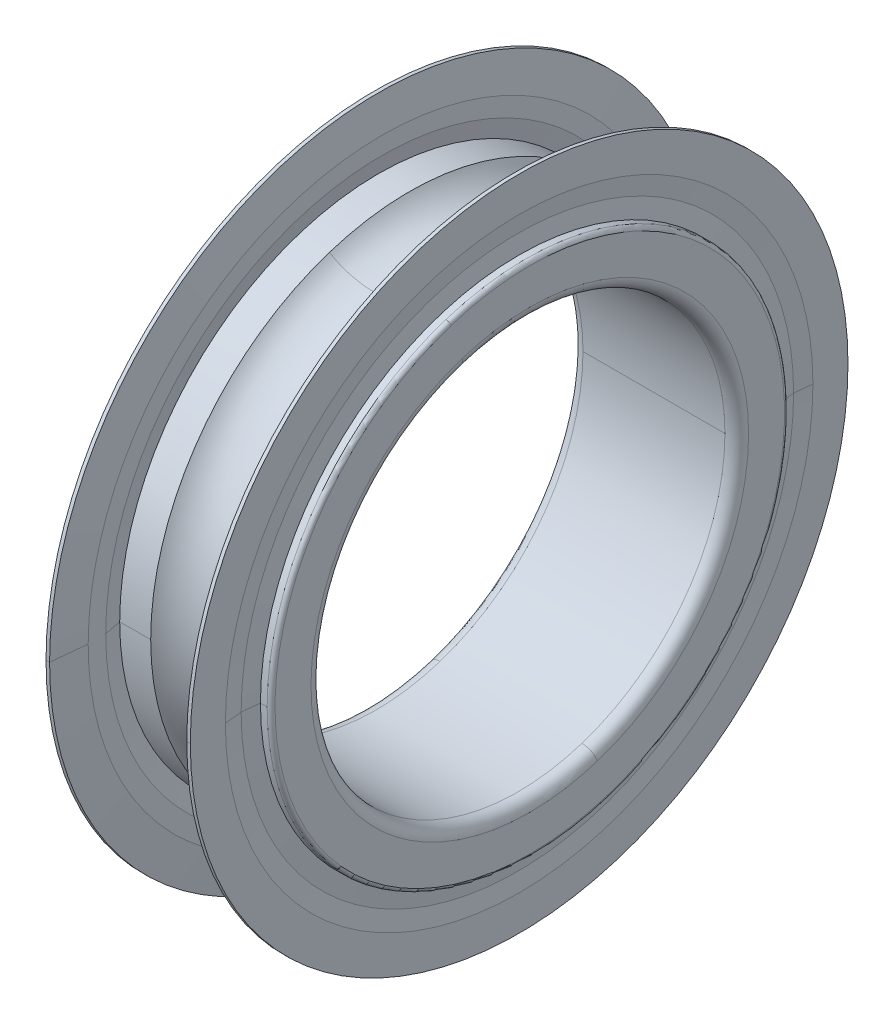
ISO-10303-21;
HEADER;
FILE_DESCRIPTION(('STEP AP214'),'2;1');
FILE_NAME('part.step','',(''),(''),'','','');
FILE_SCHEMA(('AUTOMOTIVE_DESIGN { 1 0 10303 214 1 1 1 1 }'));
ENDSEC;
DATA;
#1=APPLICATION_CONTEXT('core data for automotive mechanical design processes');
#2=APPLICATION_PROTOCOL_DEFINITION('international standard','automotive_design',2000,#1);
#3=PRODUCT_CONTEXT('',#1,'mechanical');
#4=PRODUCT('Part','Part','',(#3));
#5=PRODUCT_RELATED_PRODUCT_CATEGORY('part','',(#4));
#6=PRODUCT_DEFINITION_FORMATION('','',#4);
#7=PRODUCT_DEFINITION_CONTEXT('part definition',#1,'design');
#8=PRODUCT_DEFINITION('design','',#6,#7);
#9=PRODUCT_DEFINITION_SHAPE('','',#8);
#10=(LENGTH_UNIT() NAMED_UNIT(*) SI_UNIT(.MILLI.,.METRE.));
#11=(NAMED_UNIT(*) PLANE_ANGLE_UNIT() SI_UNIT($,.RADIAN.));
#12=(NAMED_UNIT(*) SI_UNIT($,.STERADIAN.) SOLID_ANGLE_UNIT());
#13=UNCERTAINTY_MEASURE_WITH_UNIT(LENGTH_MEASURE(1.E-05),#10,'distance_accuracy_value','');
#14=(GEOMETRIC_REPRESENTATION_CONTEXT(3) GLOBAL_UNCERTAINTY_ASSIGNED_CONTEXT((#13)) GLOBAL_UNIT_ASSIGNED_CONTEXT((#10,
#11,#12)) REPRESENTATION_CONTEXT('',''));
#15=CARTESIAN_POINT('',(0.,0.,0.));
#16=DIRECTION('',(0.,0.,1.));
#17=DIRECTION('',(1.,0.,0.));
#18=AXIS2_PLACEMENT_3D('',#15,#16,#17);
#19=CARTESIAN_POINT('',(50.,0.,0.));
#20=DIRECTION('',(1.,0.,0.));
#21=DIRECTION('',(0.,1.,0.));
#22=AXIS2_PLACEMENT_3D('',#19,#20,#21);
#23=CYLINDRICAL_SURFACE('',#22,21.875);
#24=DIRECTION('',(1.,0.,0.));
#25=VECTOR('',#24,1.);
#26=CARTESIAN_POINT('',(10.179989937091,0.,21.875));
#27=LINE('',#26,#25);
#28=CARTESIAN_POINT('',(10.179989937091,0.,21.875));
#29=VERTEX_POINT('',#28);
#30=CARTESIAN_POINT('',(12.8,0.,21.875));
#31=VERTEX_POINT('',#30);
#32=EDGE_CURVE('E10',#29,#31,#27,.T.);
#33=ORIENTED_EDGE('',*,*,#32,.F.);
#34=CARTESIAN_POINT('',(10.179989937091,0.,0.));
#35=DIRECTION('',(1.,0.,0.));
#36=DIRECTION('',(0.,0.,-1.));
#37=AXIS2_PLACEMENT_3D('',#34,#35,#36);
#38=CIRCLE('',#37,21.875);
#39=CARTESIAN_POINT('',(10.179989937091,-20.8043612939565,-6.75974675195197));
#40=VERTEX_POINT('',#39);
#41=EDGE_CURVE('E24',#29,#40,#38,.T.);
#42=ORIENTED_EDGE('',*,*,#41,.T.);
#43=CARTESIAN_POINT('',(10.179989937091,0.,0.));
#44=DIRECTION('',(1.,0.,0.));
#45=DIRECTION('',(0.,0.,-1.));
#46=AXIS2_PLACEMENT_3D('',#43,#44,#45);
#47=CIRCLE('',#46,21.875);
#48=CARTESIAN_POINT('',(10.179989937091,0.,-21.875));
#49=VERTEX_POINT('',#48);
#50=EDGE_CURVE('E685',#40,#49,#47,.T.);
#51=ORIENTED_EDGE('',*,*,#50,.T.);
#52=DIRECTION('',(1.,0.,0.));
#53=VECTOR('',#52,1.);
#54=CARTESIAN_POINT('',(10.179989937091,0.,-21.875));
#55=LINE('',#54,#53);
#56=CARTESIAN_POINT('',(12.8,0.,-21.875));
#57=VERTEX_POINT('',#56);
#58=EDGE_CURVE('E681',#49,#57,#55,.T.);
#59=ORIENTED_EDGE('',*,*,#58,.T.);
#60=CARTESIAN_POINT('',(12.8,0.,0.));
#61=DIRECTION('',(1.,0.,0.));
#62=DIRECTION('',(0.,0.,-1.));
#63=AXIS2_PLACEMENT_3D('',#60,#61,#62);
#64=CIRCLE('',#63,21.875);
#65=EDGE_CURVE('E676',#31,#57,#64,.T.);
#66=ORIENTED_EDGE('',*,*,#65,.F.);
#67=EDGE_LOOP('',(#33,#42,#51,#59,#66));
#68=FACE_BOUND('',#67,.T.);
#69=ADVANCED_FACE('F16',(#68),#23,.T.);
#70=CARTESIAN_POINT('',(12.5,0.,0.));
#71=DIRECTION('',(-1.,0.,0.));
#72=DIRECTION('',(0.,1.,0.));
#73=AXIS2_PLACEMENT_3D('',#70,#71,#72);
#74=CONICAL_SURFACE('',#73,23.3575,1.37113172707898);
#75=DIRECTION('',(-0.198340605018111,0.,-0.980133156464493));
#76=VECTOR('',#75,1.);
#77=CARTESIAN_POINT('',(12.8,0.,-21.875));
#78=LINE('',#77,#76);
#79=CARTESIAN_POINT('',(12.5,0.,-23.3575));
#80=VERTEX_POINT('',#79);
#81=EDGE_CURVE('E674',#57,#80,#78,.T.);
#82=ORIENTED_EDGE('',*,*,#81,.T.);
#83=CARTESIAN_POINT('',(12.5,0.,23.3575));
#84=CARTESIAN_POINT('',(12.5,-3.6689706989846,23.3574461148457));
#85=CARTESIAN_POINT('',(12.5,-7.33804487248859,22.6373252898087));
#86=CARTESIAN_POINT('',(12.5,-10.8181933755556,21.1956920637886));
#87=CARTESIAN_POINT('',(12.5,-17.0255412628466,17.0255465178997));
#88=CARTESIAN_POINT('',(12.5,-21.1957106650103,10.8182014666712));
#89=CARTESIAN_POINT('',(12.5,-22.637261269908,7.33800712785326));
#90=CARTESIAN_POINT('',(12.5,-24.077738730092,0.));
#91=CARTESIAN_POINT('',(12.5,-22.637261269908,-7.33800712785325));
#92=CARTESIAN_POINT('',(12.5,-21.1957106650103,-10.8182014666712));
#93=CARTESIAN_POINT('',(12.5,-17.0255412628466,-17.0255465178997));
#94=CARTESIAN_POINT('',(12.5,-10.8181933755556,-21.1956920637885));
#95=CARTESIAN_POINT('',(12.5,-7.33804487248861,-22.6373252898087));
#96=CARTESIAN_POINT('',(12.5,-3.66897069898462,-23.3574461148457));
#97=CARTESIAN_POINT('',(12.5,0.,-23.3575));
#98=B_SPLINE_CURVE_WITH_KNOTS('',5,(#83,#84,#85,#86,#87,#88,#89,#90,#91,#92,#93,#94,#95,#96,
#97),.UNSPECIFIED.,.F.,.F.,(6,3,3,3,6),(3.14159265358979,3.92699081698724,4.71238898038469,
5.49778714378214,6.28318530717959),.UNSPECIFIED.);
#99=CARTESIAN_POINT('',(12.5,0.,23.3575));
#100=VERTEX_POINT('',#99);
#101=EDGE_CURVE('E672',#100,#80,#98,.T.);
#102=ORIENTED_EDGE('',*,*,#101,.F.);
#103=DIRECTION('',(-0.198340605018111,0.,0.980133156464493));
#104=VECTOR('',#103,1.);
#105=CARTESIAN_POINT('',(12.8,0.,21.875));
#106=LINE('',#105,#104);
#107=EDGE_CURVE('E702',#31,#100,#106,.T.);
#108=ORIENTED_EDGE('',*,*,#107,.F.);
#109=ORIENTED_EDGE('',*,*,#65,.T.);
#110=EDGE_LOOP('',(#82,#102,#108,#109));
#111=FACE_BOUND('',#110,.T.);
#112=ADVANCED_FACE('F643',(#111),#74,.F.);
#113=CARTESIAN_POINT('',(12.5,0.,0.));
#114=DIRECTION('',(-1.,0.,0.));
#115=DIRECTION('',(0.,-1.,0.));
#116=AXIS2_PLACEMENT_3D('',#113,#114,#115);
#117=CONICAL_SURFACE('',#116,23.3575,1.37113172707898);
#118=ORIENTED_EDGE('',*,*,#81,.F.);
#119=CARTESIAN_POINT('',(12.8,0.,0.));
#120=DIRECTION('',(1.,0.,0.));
#121=DIRECTION('',(0.,0.,-1.));
#122=AXIS2_PLACEMENT_3D('',#119,#120,#121);
#123=CIRCLE('',#122,21.875);
#124=EDGE_CURVE('E700',#57,#31,#123,.T.);
#125=ORIENTED_EDGE('',*,*,#124,.T.);
#126=ORIENTED_EDGE('',*,*,#107,.T.);
#127=CARTESIAN_POINT('',(12.5,0.,0.));
#128=DIRECTION('',(1.,0.,0.));
#129=DIRECTION('',(0.,0.,-1.));
#130=AXIS2_PLACEMENT_3D('',#127,#128,#129);
#131=CIRCLE('',#130,23.3575);
#132=EDGE_CURVE('E703',#80,#100,#131,.T.);
#133=ORIENTED_EDGE('',*,*,#132,.F.);
#134=EDGE_LOOP('',(#118,#125,#126,#133));
#135=FACE_BOUND('',#134,.T.);
#136=ADVANCED_FACE('F647',(#135),#117,.F.);
#137=CARTESIAN_POINT('',(12.5,24.84,0.));
#138=DIRECTION('',(-1.,0.,0.));
#139=DIRECTION('',(0.,0.,1.));
#140=AXIS2_PLACEMENT_3D('',#137,#138,#139);
#141=PLANE('',#140);
#142=ORIENTED_EDGE('',*,*,#132,.T.);
#143=ORIENTED_EDGE('',*,*,#101,.T.);
#144=EDGE_LOOP('',(#142,#143));
#145=FACE_BOUND('',#144,.T.);
#146=CARTESIAN_POINT('',(12.5,0.,0.));
#147=DIRECTION('',(1.,0.,0.));
#148=DIRECTION('',(0.,0.,1.));
#149=AXIS2_PLACEMENT_3D('',#146,#147,#148);
#150=CIRCLE('',#149,24.84);
#151=CARTESIAN_POINT('',(12.5,0.,24.84));
#152=VERTEX_POINT('',#151);
#153=CARTESIAN_POINT('',(12.5,0.,-24.84));
#154=VERTEX_POINT('',#153);
#155=EDGE_CURVE('E712',#152,#154,#150,.T.);
#156=ORIENTED_EDGE('',*,*,#155,.F.);
#157=CARTESIAN_POINT('',(12.5,0.,0.));
#158=DIRECTION('',(1.,0.,0.));
#159=DIRECTION('',(0.,0.,-1.));
#160=AXIS2_PLACEMENT_3D('',#157,#158,#159);
#161=CIRCLE('',#160,24.84);
#162=EDGE_CURVE('E746',#154,#152,#161,.T.);
#163=ORIENTED_EDGE('',*,*,#162,.F.);
#164=EDGE_LOOP('',(#156,#163));
#165=FACE_BOUND('',#164,.T.);
#166=ADVANCED_FACE('F652',(#145,#165),#141,.T.);
#167=CARTESIAN_POINT('',(12.8,0.,0.));
#168=DIRECTION('',(1.,0.,0.));
#169=DIRECTION('',(0.,-1.,0.));
#170=AXIS2_PLACEMENT_3D('',#167,#168,#169);
#171=CONICAL_SURFACE('',#170,27.805,1.46995906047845);
#172=DIRECTION('',(0.100666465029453,0.,0.994920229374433));
#173=VECTOR('',#172,1.);
#174=CARTESIAN_POINT('',(12.5,0.,24.84));
#175=LINE('',#174,#173);
#176=CARTESIAN_POINT('',(12.8,0.,27.805));
#177=VERTEX_POINT('',#176);
#178=EDGE_CURVE('E759',#152,#177,#175,.T.);
#179=ORIENTED_EDGE('',*,*,#178,.T.);
#180=CARTESIAN_POINT('',(12.8,0.,0.));
#181=DIRECTION('',(1.,0.,0.));
#182=DIRECTION('',(0.,0.,-1.));
#183=AXIS2_PLACEMENT_3D('',#180,#181,#182);
#184=CIRCLE('',#183,27.805);
#185=CARTESIAN_POINT('',(12.8,0.,-27.805));
#186=VERTEX_POINT('',#185);
#187=EDGE_CURVE('E763',#186,#177,#184,.T.);
#188=ORIENTED_EDGE('',*,*,#187,.F.);
#189=DIRECTION('',(0.100666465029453,0.,-0.994920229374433));
#190=VECTOR('',#189,1.);
#191=CARTESIAN_POINT('',(12.5,0.,-24.84));
#192=LINE('',#191,#190);
#193=EDGE_CURVE('E761',#154,#186,#192,.T.);
#194=ORIENTED_EDGE('',*,*,#193,.F.);
#195=ORIENTED_EDGE('',*,*,#162,.T.);
#196=EDGE_LOOP('',(#179,#188,#194,#195));
#197=FACE_BOUND('',#196,.T.);
#198=ADVANCED_FACE('F727',(#197),#171,.T.);
#199=CARTESIAN_POINT('',(12.8,0.,0.));
#200=DIRECTION('',(1.,0.,0.));
#201=DIRECTION('',(0.,1.,0.));
#202=AXIS2_PLACEMENT_3D('',#199,#200,#201);
#203=CONICAL_SURFACE('',#202,27.805,1.46995906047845);
#204=ORIENTED_EDGE('',*,*,#178,.F.);
#205=ORIENTED_EDGE('',*,*,#155,.T.);
#206=ORIENTED_EDGE('',*,*,#193,.T.);
#207=CARTESIAN_POINT('',(12.8,0.,0.));
#208=DIRECTION('',(1.,0.,0.));
#209=DIRECTION('',(0.,0.,-1.));
#210=AXIS2_PLACEMENT_3D('',#207,#208,#209);
#211=CIRCLE('',#210,27.805);
#212=EDGE_CURVE('E768',#177,#186,#211,.T.);
#213=ORIENTED_EDGE('',*,*,#212,.F.);
#214=EDGE_LOOP('',(#204,#205,#206,#213));
#215=FACE_BOUND('',#214,.T.);
#216=ADVANCED_FACE('F771',(#215),#203,.T.);
#217=CARTESIAN_POINT('',(2.,0.,0.));
#218=DIRECTION('',(1.,0.,0.));
#219=DIRECTION('',(0.,1.,0.));
#220=AXIS2_PLACEMENT_3D('',#217,#218,#219);
#221=CYLINDRICAL_SURFACE('',#220,27.805);
#222=DIRECTION('',(1.,0.,0.));
#223=VECTOR('',#222,1.);
#224=CARTESIAN_POINT('',(12.8,0.,27.805));
#225=LINE('',#224,#223);
#226=CARTESIAN_POINT('',(13.1,0.,27.805));
#227=VERTEX_POINT('',#226);
#228=EDGE_CURVE('E791',#177,#227,#225,.T.);
#229=ORIENTED_EDGE('',*,*,#228,.F.);
#230=ORIENTED_EDGE('',*,*,#212,.T.);
#231=DIRECTION('',(1.,0.,0.));
#232=VECTOR('',#231,1.);
#233=CARTESIAN_POINT('',(12.8,0.,-27.805));
#234=LINE('',#233,#232);
#235=CARTESIAN_POINT('',(13.1,0.,-27.805));
#236=VERTEX_POINT('',#235);
#237=EDGE_CURVE('E800',#186,#236,#234,.T.);
#238=ORIENTED_EDGE('',*,*,#237,.T.);
#239=CARTESIAN_POINT('',(13.1,0.,0.));
#240=DIRECTION('',(1.,0.,0.));
#241=DIRECTION('',(0.,0.,-1.));
#242=AXIS2_PLACEMENT_3D('',#239,#240,#241);
#243=CIRCLE('',#242,27.805);
#244=EDGE_CURVE('E796',#227,#236,#243,.T.);
#245=ORIENTED_EDGE('',*,*,#244,.F.);
#246=EDGE_LOOP('',(#229,#230,#238,#245));
#247=FACE_BOUND('',#246,.T.);
#248=ADVANCED_FACE('F794',(#247),#221,.T.);
#249=CARTESIAN_POINT('',(13.1,24.84,0.));
#250=DIRECTION('',(1.,0.,0.));
#251=DIRECTION('',(0.,0.,-1.));
#252=AXIS2_PLACEMENT_3D('',#249,#250,#251);
#253=PLANE('',#252);
#254=CARTESIAN_POINT('',(13.1,0.,0.));
#255=DIRECTION('',(1.,0.,0.));
#256=DIRECTION('',(0.,0.,-1.));
#257=AXIS2_PLACEMENT_3D('',#254,#255,#256);
#258=CIRCLE('',#257,27.805);
#259=EDGE_CURVE('E803',#236,#227,#258,.T.);
#260=ORIENTED_EDGE('',*,*,#259,.T.);
#261=ORIENTED_EDGE('',*,*,#244,.T.);
#262=EDGE_LOOP('',(#260,#261));
#263=FACE_BOUND('',#262,.T.);
#264=CARTESIAN_POINT('',(13.1,0.,0.));
#265=DIRECTION('',(1.,0.,0.));
#266=DIRECTION('',(0.,0.,1.));
#267=AXIS2_PLACEMENT_3D('',#264,#265,#266);
#268=CIRCLE('',#267,24.84);
#269=CARTESIAN_POINT('',(13.1,0.,24.84));
#270=VERTEX_POINT('',#269);
#271=CARTESIAN_POINT('',(13.1,0.,-24.84));
#272=VERTEX_POINT('',#271);
#273=EDGE_CURVE('E817',#270,#272,#268,.T.);
#274=ORIENTED_EDGE('',*,*,#273,.F.);
#275=CARTESIAN_POINT('',(13.1,0.,0.));
#276=DIRECTION('',(1.,0.,0.));
#277=DIRECTION('',(0.,0.,-1.));
#278=AXIS2_PLACEMENT_3D('',#275,#276,#277);
#279=CIRCLE('',#278,24.84);
#280=EDGE_CURVE('E854',#272,#270,#279,.T.);
#281=ORIENTED_EDGE('',*,*,#280,.F.);
#282=EDGE_LOOP('',(#274,#281));
#283=FACE_BOUND('',#282,.T.);
#284=ADVANCED_FACE('F827',(#263,#283),#253,.T.);
#285=CARTESIAN_POINT('',(12.95,0.,0.));
#286=DIRECTION('',(1.,0.,0.));
#287=DIRECTION('',(0.,-1.,0.));
#288=AXIS2_PLACEMENT_3D('',#285,#286,#287);
#289=CONICAL_SURFACE('',#288,23.3575,1.46995906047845);
#290=DIRECTION('',(0.100666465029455,0.,0.994920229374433));
#291=VECTOR('',#290,1.);
#292=CARTESIAN_POINT('',(12.95,0.,23.3575));
#293=LINE('',#292,#291);
#294=CARTESIAN_POINT('',(12.95,0.,23.3575));
#295=VERTEX_POINT('',#294);
#296=EDGE_CURVE('E852',#295,#270,#293,.T.);
#297=ORIENTED_EDGE('',*,*,#296,.F.);
#298=CARTESIAN_POINT('',(12.95,0.,0.));
#299=DIRECTION('',(1.,0.,0.));
#300=DIRECTION('',(0.,0.,-1.));
#301=AXIS2_PLACEMENT_3D('',#298,#299,#300);
#302=CIRCLE('',#301,23.3575);
#303=CARTESIAN_POINT('',(12.95,0.,-23.3575));
#304=VERTEX_POINT('',#303);
#305=EDGE_CURVE('E855',#304,#295,#302,.T.);
#306=ORIENTED_EDGE('',*,*,#305,.F.);
#307=DIRECTION('',(0.100666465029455,0.,-0.994920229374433));
#308=VECTOR('',#307,1.);
#309=CARTESIAN_POINT('',(12.95,0.,-23.3575));
#310=LINE('',#309,#308);
#311=EDGE_CURVE('E860',#304,#272,#310,.T.);
#312=ORIENTED_EDGE('',*,*,#311,.T.);
#313=ORIENTED_EDGE('',*,*,#280,.T.);
#314=EDGE_LOOP('',(#297,#306,#312,#313));
#315=FACE_BOUND('',#314,.T.);
#316=ADVANCED_FACE('F837',(#315),#289,.F.);
#317=CARTESIAN_POINT('',(12.95,0.,0.));
#318=DIRECTION('',(1.,0.,0.));
#319=DIRECTION('',(0.,1.,0.));
#320=AXIS2_PLACEMENT_3D('',#317,#318,#319);
#321=CONICAL_SURFACE('',#320,23.3575,1.46995906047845);
#322=ORIENTED_EDGE('',*,*,#296,.T.);
#323=ORIENTED_EDGE('',*,*,#273,.T.);
#324=ORIENTED_EDGE('',*,*,#311,.F.);
#325=CARTESIAN_POINT('',(12.95,0.,0.));
#326=DIRECTION('',(1.,0.,0.));
#327=DIRECTION('',(0.,0.,-1.));
#328=AXIS2_PLACEMENT_3D('',#325,#326,#327);
#329=CIRCLE('',#328,23.3575);
#330=EDGE_CURVE('E865',#295,#304,#329,.T.);
#331=ORIENTED_EDGE('',*,*,#330,.F.);
#332=EDGE_LOOP('',(#322,#323,#324,#331));
#333=FACE_BOUND('',#332,.T.);
#334=ADVANCED_FACE('F885',(#333),#321,.F.);
#335=CARTESIAN_POINT('',(13.1,0.,0.));
#336=DIRECTION('',(-1.,0.,0.));
#337=DIRECTION('',(0.,1.,0.));
#338=AXIS2_PLACEMENT_3D('',#335,#336,#337);
#339=CONICAL_SURFACE('',#338,21.875,1.46995906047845);
#340=DIRECTION('',(-0.100666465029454,0.,-0.994920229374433));
#341=VECTOR('',#340,1.);
#342=CARTESIAN_POINT('',(13.1,0.,-21.875));
#343=LINE('',#342,#341);
#344=CARTESIAN_POINT('',(13.1,0.,-21.875));
#345=VERTEX_POINT('',#344);
#346=EDGE_CURVE('E995',#345,#304,#343,.T.);
#347=ORIENTED_EDGE('',*,*,#346,.F.);
#348=CARTESIAN_POINT('',(13.1,0.,0.));
#349=DIRECTION('',(1.,0.,0.));
#350=DIRECTION('',(0.,0.,-1.));
#351=AXIS2_PLACEMENT_3D('',#348,#349,#350);
#352=CIRCLE('',#351,21.875);
#353=CARTESIAN_POINT('',(13.1,0.,21.875));
#354=VERTEX_POINT('',#353);
#355=EDGE_CURVE('E990',#354,#345,#352,.T.);
#356=ORIENTED_EDGE('',*,*,#355,.F.);
#357=DIRECTION('',(-0.100666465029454,0.,0.994920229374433));
#358=VECTOR('',#357,1.);
#359=CARTESIAN_POINT('',(13.1,0.,21.875));
#360=LINE('',#359,#358);
#361=EDGE_CURVE('E985',#354,#295,#360,.T.);
#362=ORIENTED_EDGE('',*,*,#361,.T.);
#363=ORIENTED_EDGE('',*,*,#330,.T.);
#364=EDGE_LOOP('',(#347,#356,#362,#363));
#365=FACE_BOUND('',#364,.T.);
#366=ADVANCED_FACE('F894',(#365),#339,.T.);
#367=CARTESIAN_POINT('',(13.1,0.,0.));
#368=DIRECTION('',(-1.,0.,0.));
#369=DIRECTION('',(0.,-1.,0.));
#370=AXIS2_PLACEMENT_3D('',#367,#368,#369);
#371=CONICAL_SURFACE('',#370,21.875,1.46995906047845);
#372=ORIENTED_EDGE('',*,*,#346,.T.);
#373=ORIENTED_EDGE('',*,*,#305,.T.);
#374=ORIENTED_EDGE('',*,*,#361,.F.);
#375=CARTESIAN_POINT('',(13.1,0.,0.));
#376=DIRECTION('',(1.,0.,0.));
#377=DIRECTION('',(0.,0.,-1.));
#378=AXIS2_PLACEMENT_3D('',#375,#376,#377);
#379=CIRCLE('',#378,21.875);
#380=EDGE_CURVE('E980',#345,#354,#379,.T.);
#381=ORIENTED_EDGE('',*,*,#380,.F.);
#382=EDGE_LOOP('',(#372,#373,#374,#381));
#383=FACE_BOUND('',#382,.T.);
#384=ADVANCED_FACE('F897',(#383),#371,.T.);
#385=CARTESIAN_POINT('',(50.,0.,0.));
#386=DIRECTION('',(1.,0.,0.));
#387=DIRECTION('',(0.,-1.,0.));
#388=AXIS2_PLACEMENT_3D('',#385,#386,#387);
#389=CYLINDRICAL_SURFACE('',#388,21.875);
#390=DIRECTION('',(1.,0.,0.));
#391=VECTOR('',#390,1.);
#392=CARTESIAN_POINT('',(13.1,0.,21.875));
#393=LINE('',#392,#391);
#394=CARTESIAN_POINT('',(13.666666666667,0.,21.875));
#395=VERTEX_POINT('',#394);
#396=EDGE_CURVE('E976',#354,#395,#393,.T.);
#397=ORIENTED_EDGE('',*,*,#396,.T.);
#398=CARTESIAN_POINT('',(13.666666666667,0.,0.));
#399=DIRECTION('',(1.,0.,0.));
#400=DIRECTION('',(0.,0.,-1.));
#401=AXIS2_PLACEMENT_3D('',#398,#399,#400);
#402=CIRCLE('',#401,21.875);
#403=CARTESIAN_POINT('',(13.666666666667,20.8043612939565,6.75974675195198));
#404=VERTEX_POINT('',#403);
#405=EDGE_CURVE('E971',#404,#395,#402,.T.);
#406=ORIENTED_EDGE('',*,*,#405,.F.);
#407=CARTESIAN_POINT('',(13.666666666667,0.,0.));
#408=DIRECTION('',(1.,0.,0.));
#409=DIRECTION('',(0.,0.,-1.));
#410=AXIS2_PLACEMENT_3D('',#407,#408,#409);
#411=CIRCLE('',#410,21.875);
#412=CARTESIAN_POINT('',(13.666666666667,0.,-21.875));
#413=VERTEX_POINT('',#412);
#414=EDGE_CURVE('E966',#413,#404,#411,.T.);
#415=ORIENTED_EDGE('',*,*,#414,.F.);
#416=DIRECTION('',(1.,0.,0.));
#417=VECTOR('',#416,1.);
#418=CARTESIAN_POINT('',(13.1,0.,-21.875));
#419=LINE('',#418,#417);
#420=EDGE_CURVE('E961',#345,#413,#419,.T.);
#421=ORIENTED_EDGE('',*,*,#420,.F.);
#422=ORIENTED_EDGE('',*,*,#380,.T.);
#423=EDGE_LOOP('',(#397,#406,#415,#421,#422));
#424=FACE_BOUND('',#423,.T.);
#425=ADVANCED_FACE('F901',(#424),#389,.T.);
#426=CARTESIAN_POINT('',(50.,0.,0.));
#427=DIRECTION('',(1.,0.,0.));
#428=DIRECTION('',(0.,1.,0.));
#429=AXIS2_PLACEMENT_3D('',#426,#427,#428);
#430=CYLINDRICAL_SURFACE('',#429,21.875);
#431=ORIENTED_EDGE('',*,*,#396,.F.);
#432=ORIENTED_EDGE('',*,*,#355,.T.);
#433=ORIENTED_EDGE('',*,*,#420,.T.);
#434=CARTESIAN_POINT('',(13.666666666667,0.,0.));
#435=DIRECTION('',(1.,0.,0.));
#436=DIRECTION('',(0.,0.,-1.));
#437=AXIS2_PLACEMENT_3D('',#434,#435,#436);
#438=CIRCLE('',#437,21.875);
#439=CARTESIAN_POINT('',(13.666666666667,-20.8043612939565,-6.75974675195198));
#440=VERTEX_POINT('',#439);
#441=EDGE_CURVE('E956',#440,#413,#438,.T.);
#442=ORIENTED_EDGE('',*,*,#441,.F.);
#443=CARTESIAN_POINT('',(13.666666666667,0.,0.));
#444=DIRECTION('',(1.,0.,0.));
#445=DIRECTION('',(0.,0.,-1.));
#446=AXIS2_PLACEMENT_3D('',#443,#444,#445);
#447=CIRCLE('',#446,21.875);
#448=EDGE_CURVE('E951',#395,#440,#447,.T.);
#449=ORIENTED_EDGE('',*,*,#448,.F.);
#450=EDGE_LOOP('',(#431,#432,#433,#442,#449));
#451=FACE_BOUND('',#450,.T.);
#452=ADVANCED_FACE('F905',(#451),#430,.T.);
#453=CARTESIAN_POINT('',(13.666666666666,0.,0.));
#454=DIRECTION('',(1.,0.,0.));
#455=DIRECTION('',(0.,0.309016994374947,-0.951056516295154));
#456=AXIS2_PLACEMENT_3D('',#453,#454,#455);
#457=TOROIDAL_SURFACE('',#456,21.541666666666,0.333333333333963);
#458=CARTESIAN_POINT('',(13.666666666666,-20.4873424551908,-6.65674108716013));
#459=DIRECTION('',(0.,0.309016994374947,-0.951056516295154));
#460=DIRECTION('',(1.,0.,0.));
#461=AXIS2_PLACEMENT_3D('',#458,#459,#460);
#462=CIRCLE('',#461,0.333333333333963);
#463=CARTESIAN_POINT('',(14.,-20.4873424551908,-6.65674108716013));
#464=VERTEX_POINT('',#463);
#465=EDGE_CURVE('E947',#464,#440,#462,.T.);
#466=ORIENTED_EDGE('',*,*,#465,.F.);
#467=CARTESIAN_POINT('',(14.,0.,0.));
#468=DIRECTION('',(1.,0.,0.));
#469=DIRECTION('',(0.,0.,-1.));
#470=AXIS2_PLACEMENT_3D('',#467,#468,#469);
#471=CIRCLE('',#470,21.541666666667);
#472=CARTESIAN_POINT('',(14.,20.4873424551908,6.65674108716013));
#473=VERTEX_POINT('',#472);
#474=EDGE_CURVE('E943',#473,#464,#471,.T.);
#475=ORIENTED_EDGE('',*,*,#474,.F.);
#476=CARTESIAN_POINT('',(13.666666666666,20.4873424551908,6.65674108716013));
#477=DIRECTION('',(0.,-0.309016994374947,0.951056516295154));
#478=DIRECTION('',(1.,0.,0.));
#479=AXIS2_PLACEMENT_3D('',#476,#477,#478);
#480=CIRCLE('',#479,0.333333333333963);
#481=EDGE_CURVE('E940',#473,#404,#480,.T.);
#482=ORIENTED_EDGE('',*,*,#481,.T.);
#483=ORIENTED_EDGE('',*,*,#405,.T.);
#484=ORIENTED_EDGE('',*,*,#448,.T.);
#485=EDGE_LOOP('',(#466,#475,#482,#483,#484));
#486=FACE_BOUND('',#485,.T.);
#487=ADVANCED_FACE('F909',(#486),#457,.T.);
#488=CARTESIAN_POINT('',(13.666666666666,0.,0.));
#489=DIRECTION('',(1.,0.,0.));
#490=DIRECTION('',(0.,-0.309016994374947,0.951056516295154));
#491=AXIS2_PLACEMENT_3D('',#488,#489,#490);
#492=TOROIDAL_SURFACE('',#491,21.541666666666,0.333333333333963);
#493=ORIENTED_EDGE('',*,*,#465,.T.);
#494=ORIENTED_EDGE('',*,*,#441,.T.);
#495=ORIENTED_EDGE('',*,*,#414,.T.);
#496=ORIENTED_EDGE('',*,*,#481,.F.);
#497=CARTESIAN_POINT('',(14.,-20.4873424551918,-6.65674108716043));
#498=CARTESIAN_POINT('',(14.,-19.4416615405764,-9.87485520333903));
#499=CARTESIAN_POINT('',(14.,-17.7643656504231,-12.887845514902));
#500=CARTESIAN_POINT('',(14.,-15.5080590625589,-15.5294987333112));
#501=CARTESIAN_POINT('',(14.,-10.0812836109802,-19.7856255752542));
#502=CARTESIAN_POINT('',(14.,-3.44822177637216,-21.6743122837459));
#503=CARTESIAN_POINT('',(14.,0.0151609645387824,-21.9468923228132));
#504=CARTESIAN_POINT('',(14.,6.86200461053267,-21.1190786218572));
#505=CARTESIAN_POINT('',(14.,12.8877941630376,-17.7643202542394));
#506=CARTESIAN_POINT('',(14.,15.5295111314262,-15.5080730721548));
#507=CARTESIAN_POINT('',(14.,19.7856286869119,-10.0812775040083));
#508=CARTESIAN_POINT('',(14.,21.6742936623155,-3.44821998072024));
#509=CARTESIAN_POINT('',(14.,21.946959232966,0.0151461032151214));
#510=CARTESIAN_POINT('',(14.,21.5329288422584,3.43859625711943));
#511=CARTESIAN_POINT('',(14.,20.4873424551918,6.65674108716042));
#512=B_SPLINE_CURVE_WITH_KNOTS('',5,(#497,#498,#499,#500,#501,#502,#503,#504,#505,#506,#507,
#508,#509,#510,#511),.UNSPECIFIED.,.F.,.F.,(6,3,3,3,6),(0.,0.785398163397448,1.5707963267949,
2.35619449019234,3.14159265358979),.UNSPECIFIED.);
#513=EDGE_CURVE('E938',#464,#473,#512,.T.);
#514=ORIENTED_EDGE('',*,*,#513,.F.);
#515=EDGE_LOOP('',(#493,#494,#495,#496,#514));
#516=FACE_BOUND('',#515,.T.);
#517=ADVANCED_FACE('F913',(#516),#492,.T.);
#518=CARTESIAN_POINT('',(14.,18.5,0.));
#519=DIRECTION('',(1.,0.,0.));
#520=DIRECTION('',(0.,0.,-1.));
#521=AXIS2_PLACEMENT_3D('',#518,#519,#520);
#522=PLANE('',#521);
#523=ORIENTED_EDGE('',*,*,#474,.T.);
#524=ORIENTED_EDGE('',*,*,#513,.T.);
#525=EDGE_LOOP('',(#523,#524));
#526=FACE_BOUND('',#525,.T.);
#527=CARTESIAN_POINT('',(14.,-17.5945455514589,-5.71681439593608));
#528=CARTESIAN_POINT('',(14.,-17.5010104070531,-6.00470674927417));
#529=CARTESIAN_POINT('',(14.,-17.4003975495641,-6.29029883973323));
#530=CARTESIAN_POINT('',(14.,-17.1852851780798,-6.85620450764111));
#531=CARTESIAN_POINT('',(14.,-17.0707856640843,-7.13651808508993));
#532=CARTESIAN_POINT('',(14.,-16.8281687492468,-7.6911887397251));
#533=CARTESIAN_POINT('',(14.,-16.7000513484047,-7.96554581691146));
#534=CARTESIAN_POINT('',(14.,-16.4305092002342,-8.50764324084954));
#535=CARTESIAN_POINT('',(14.,-16.2890844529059,-8.77538358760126));
#536=CARTESIAN_POINT('',(14.,-15.9932678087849,-9.3036023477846));
#537=CARTESIAN_POINT('',(14.,-15.8388759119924,-9.56408076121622));
#538=CARTESIAN_POINT('',(14.,-15.5174970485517,-10.077148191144));
#539=CARTESIAN_POINT('',(14.,-15.3505100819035,-10.3297372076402));
#540=CARTESIAN_POINT('',(14.,-15.0043433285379,-10.8264173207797));
#541=CARTESIAN_POINT('',(14.,-14.8251635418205,-11.0705084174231));
#542=CARTESIAN_POINT('',(14.,-14.4550428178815,-11.5496046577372));
#543=CARTESIAN_POINT('',(14.,-14.26410188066,-11.7846098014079));
#544=CARTESIAN_POINT('',(14.,-13.8709188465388,-12.2449679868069));
#545=CARTESIAN_POINT('',(14.,-13.668676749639,-12.4703210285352));
#546=CARTESIAN_POINT('',(14.,-13.253378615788,-12.9108321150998));
#547=CARTESIAN_POINT('',(14.,-13.0403225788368,-13.1259901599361));
#548=CARTESIAN_POINT('',(14.,-12.6039098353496,-13.5455929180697));
#549=CARTESIAN_POINT('',(14.,-12.3805531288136,-13.7500376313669));
#550=CARTESIAN_POINT('',(14.,-11.9240771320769,-14.1477212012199));
#551=CARTESIAN_POINT('',(14.,-11.6909578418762,-14.3409600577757));
#552=CARTESIAN_POINT('',(14.,-11.2155182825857,-14.7157663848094));
#553=CARTESIAN_POINT('',(14.,-10.9731980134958,-14.8973338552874));
#554=CARTESIAN_POINT('',(14.,-10.4799402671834,-15.2483599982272));
#555=CARTESIAN_POINT('',(14.,-10.2290027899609,-15.4178186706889));
#556=CARTESIAN_POINT('',(14.,-9.71911515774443,-15.7442189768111));
#557=CARTESIAN_POINT('',(14.,-9.46016500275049,-15.9011606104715));
#558=CARTESIAN_POINT('',(14.,-8.93487584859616,-16.202148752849));
#559=CARTESIAN_POINT('',(14.,-8.66853684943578,-16.3461952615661));
#560=CARTESIAN_POINT('',(14.,-8.12911164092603,-16.6210461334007));
#561=CARTESIAN_POINT('',(14.,-7.85602543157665,-16.7518504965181));
#562=CARTESIAN_POINT('',(14.,-7.30376369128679,-16.9999019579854));
#563=CARTESIAN_POINT('',(14.,-7.02458816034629,-17.1171490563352));
#564=CARTESIAN_POINT('',(14.,-6.4608203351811,-17.3378035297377));
#565=CARTESIAN_POINT('',(14.,-6.17622804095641,-17.4412109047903));
#566=CARTESIAN_POINT('',(14.,-5.60231229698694,-17.6339368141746));
#567=CARTESIAN_POINT('',(14.,-5.31298884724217,-17.7232553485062));
#568=CARTESIAN_POINT('',(14.,-4.73030779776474,-17.8875884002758));
#569=CARTESIAN_POINT('',(14.,-4.43695019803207,-17.9626029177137));
#570=CARTESIAN_POINT('',(14.,-3.84690757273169,-18.0981472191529));
#571=CARTESIAN_POINT('',(14.,-3.55022254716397,-18.1586770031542));
#572=CARTESIAN_POINT('',(14.,-2.95423981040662,-18.2651060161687));
#573=CARTESIAN_POINT('',(14.,-2.65494209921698,-18.3110052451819));
#574=CARTESIAN_POINT('',(14.,-2.05445502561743,-18.3880625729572));
#575=CARTESIAN_POINT('',(14.,-1.75326566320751,-18.4192206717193));
#576=CARTESIAN_POINT('',(14.,-1.14972087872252,-18.4667206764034));
#577=CARTESIAN_POINT('',(14.,-0.847365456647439,-18.4830625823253));
#578=CARTESIAN_POINT('',(14.,-0.242216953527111,-18.5008908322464));
#579=CARTESIAN_POINT('',(14.,0.0605761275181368,-18.5023771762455));
#580=CARTESIAN_POINT('',(14.,0.665870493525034,-18.4904907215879));
#581=CARTESIAN_POINT('',(14.,0.968371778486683,-18.4771179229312));
#582=CARTESIAN_POINT('',(14.,1.57235380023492,-18.4355453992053));
#583=CARTESIAN_POINT('',(14.,1.8738345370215,-18.4073456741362));
#584=CARTESIAN_POINT('',(14.,2.4750491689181,-18.336187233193));
#585=CARTESIAN_POINT('',(14.,2.77478306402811,-18.2932285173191));
#586=CARTESIAN_POINT('',(14.,3.37178192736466,-18.1926555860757));
#587=CARTESIAN_POINT('',(14.,3.66904689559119,-18.1350413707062));
#588=CARTESIAN_POINT('',(14.,4.26039176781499,-18.005296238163));
#589=CARTESIAN_POINT('',(14.,4.55447167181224,-17.9331653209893));
#590=CARTESIAN_POINT('',(14.,5.1387379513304,-17.774560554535));
#591=CARTESIAN_POINT('',(14.,5.42892432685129,-17.6880867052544));
#592=CARTESIAN_POINT('',(14.,6.00470446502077,-17.5010043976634));
#593=CARTESIAN_POINT('',(14.,6.29029822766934,-17.400395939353));
#594=CARTESIAN_POINT('',(14.,6.85620511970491,-17.1852867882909));
#595=CARTESIAN_POINT('',(14.,7.13651824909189,-17.0707860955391));
#596=CARTESIAN_POINT('',(14.,7.69118857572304,-16.8281683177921));
#597=CARTESIAN_POINT('',(14.,7.96554577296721,-16.7000512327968));
#598=CARTESIAN_POINT('',(14.,8.5076432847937,-16.4305093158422));
#599=CARTESIAN_POINT('',(14.,8.77538359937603,-16.2890844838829));
#600=CARTESIAN_POINT('',(14.,9.30360233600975,-15.9932677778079));
#601=CARTESIAN_POINT('',(14.,9.56408075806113,-15.8388759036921));
#602=CARTESIAN_POINT('',(14.,10.077148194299,-15.517497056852));
#603=CARTESIAN_POINT('',(14.,10.3297372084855,-15.3505100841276));
#604=CARTESIAN_POINT('',(14.,10.8264173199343,-15.0043433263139));
#605=CARTESIAN_POINT('',(14.,11.0705084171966,-14.8251635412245));
#606=CARTESIAN_POINT('',(14.,11.5496046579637,-14.4550428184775));
#607=CARTESIAN_POINT('',(14.,11.7846098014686,-14.2641018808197));
#608=CARTESIAN_POINT('',(14.,12.2449679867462,-13.8709188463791));
#609=CARTESIAN_POINT('',(14.,12.4703210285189,-13.6686767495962));
#610=CARTESIAN_POINT('',(14.,12.910832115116,-13.2533786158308));
#611=CARTESIAN_POINT('',(14.,13.1259901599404,-13.0403225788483));
#612=CARTESIAN_POINT('',(14.,13.5455929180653,-12.6039098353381));
#613=CARTESIAN_POINT('',(14.,13.7500376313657,-12.3805531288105));
#614=CARTESIAN_POINT('',(14.,14.1477212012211,-11.92407713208));
#615=CARTESIAN_POINT('',(14.,14.340960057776,-11.6909578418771));
#616=CARTESIAN_POINT('',(14.,14.7157663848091,-11.2155182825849));
#617=CARTESIAN_POINT('',(14.,14.8973338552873,-10.9731980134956));
#618=CARTESIAN_POINT('',(14.,15.2483599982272,-10.4799402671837));
#619=CARTESIAN_POINT('',(14.,15.4178186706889,-10.229002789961));
#620=CARTESIAN_POINT('',(14.,15.744218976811,-9.71911515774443));
#621=CARTESIAN_POINT('',(14.,15.9011606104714,-9.46016500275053));
#622=CARTESIAN_POINT('',(14.,16.202148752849,-8.93487584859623));
#623=CARTESIAN_POINT('',(14.,16.3461952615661,-8.66853684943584));
#624=CARTESIAN_POINT('',(14.,16.6210461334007,-8.12911164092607));
#625=CARTESIAN_POINT('',(14.,16.7518504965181,-7.85602543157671));
#626=CARTESIAN_POINT('',(14.,16.9999019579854,-7.30376369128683));
#627=CARTESIAN_POINT('',(14.,17.1171490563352,-7.02458816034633));
#628=CARTESIAN_POINT('',(14.,17.3378035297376,-6.46082033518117));
#629=CARTESIAN_POINT('',(14.,17.4412109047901,-6.17622804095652));
#630=CARTESIAN_POINT('',(14.,17.6339368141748,-5.60231229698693));
#631=CARTESIAN_POINT('',(14.,17.723255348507,-5.31298884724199));
#632=CARTESIAN_POINT('',(14.,17.8875884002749,-4.73030779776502));
#633=CARTESIAN_POINT('',(14.,17.9626029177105,-4.43695019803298));
#634=CARTESIAN_POINT('',(14.,18.0981472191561,-3.84690757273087));
#635=CARTESIAN_POINT('',(14.,18.1586770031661,-3.55022254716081));
#636=CARTESIAN_POINT('',(14.,18.2651060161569,-2.95423981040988));
#637=CARTESIAN_POINT('',(14.,18.3110052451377,-2.65494209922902));
#638=CARTESIAN_POINT('',(14.,18.3880625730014,-2.05445502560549));
#639=CARTESIAN_POINT('',(14.,18.4192206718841,-1.75326566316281));
#640=CARTESIAN_POINT('',(14.,18.4667206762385,-1.14972087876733));
#641=CARTESIAN_POINT('',(14.,18.4830625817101,-0.847365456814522));
#642=CARTESIAN_POINT('',(14.,18.5008908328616,-0.242216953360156));
#643=CARTESIAN_POINT('',(14.,18.5023771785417,0.0605761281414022));
#644=CARTESIAN_POINT('',(14.,18.4904907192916,0.665870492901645));
#645=CARTESIAN_POINT('',(14.,18.4771179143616,0.968371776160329));
#646=CARTESIAN_POINT('',(14.,18.4355454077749,1.57235380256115));
#647=CARTESIAN_POINT('',(14.,18.4073457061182,1.87383454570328));
#648=CARTESIAN_POINT('',(14.,18.336187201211,2.47504916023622));
#649=CARTESIAN_POINT('',(14.,18.2932283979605,2.77478303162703));
#650=CARTESIAN_POINT('',(14.,18.1926557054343,3.37178195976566));
#651=CARTESIAN_POINT('',(14.,18.1350418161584,3.66904701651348));
#652=CARTESIAN_POINT('',(14.,18.0052957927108,4.2603916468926));
#653=CARTESIAN_POINT('',(14.,17.9331636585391,4.5544712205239));
#654=CARTESIAN_POINT('',(14.,17.7745622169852,5.13873840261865));
#655=CARTESIAN_POINT('',(14.,17.6880929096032,5.4289260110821));
#656=CARTESIAN_POINT('',(14.,17.5945455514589,5.71681439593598));
#657=B_SPLINE_CURVE_WITH_KNOTS('',3,(#527,#528,#529,#530,#531,#532,#533,#534,#535,#536,#537,
#538,#539,#540,#541,#542,#543,#544,#545,#546,#547,#548,#549,#550,#551,#552,#553,#554,#555,#556,
#557,#558,#559,#560,#561,#562,#563,#564,#565,#566,#567,#568,#569,#570,#571,#572,#573,#574,#575,
#576,#577,#578,#579,#580,#581,#582,#583,#584,#585,#586,#587,#588,#589,#590,#591,#592,#593,#594,
#595,#596,#597,#598,#599,#600,#601,#602,#603,#604,#605,#606,#607,#608,#609,#610,#611,#612,#613,
#614,#615,#616,#617,#618,#619,#620,#621,#622,#623,#624,#625,#626,#627,#628,#629,#630,#631,#632,
#633,#634,#635,#636,#637,#638,#639,#640,#641,#642,#643,#644,#645,#646,#647,#648,#649,#650,#651,
#652,#653,#654,#655,#656),.UNSPECIFIED.,.F.,.F.,(4,2,2,2,2,2,2,2,2,2,2,2,2,2,2,2,2,2,2,2,2,2,2,
2,2,2,2,2,2,2,2,2,2,2,2,2,2,2,2,2,2,2,2,2,2,2,2,2,2,2,2,2,2,2,2,2,2,2,2,2,2,2,2,2,4),(0.,
0.908025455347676,1.81605091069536,2.72407636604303,3.63210182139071,4.54012727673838,
5.44815273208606,6.35617818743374,7.26420364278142,8.17222909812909,9.08025455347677,
9.98828000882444,10.8963054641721,11.8043309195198,12.7123563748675,13.6203818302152,
14.5284072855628,15.4364327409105,16.3444581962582,17.2524836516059,18.1605091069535,
19.0685345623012,19.9765600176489,20.8845854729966,21.7926109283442,22.7006363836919,
23.6086618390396,24.5166872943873,25.424712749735,26.3327382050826,27.2407636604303,
28.148789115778,29.0568145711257,29.9648400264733,30.872865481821,31.7808909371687,
32.6889163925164,33.596941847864,34.5049673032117,35.4129927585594,36.3210182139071,
37.2290436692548,38.1370691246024,39.0450945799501,39.9531200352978,40.8611454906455,
41.7691709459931,42.6771964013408,43.5852218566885,44.4932473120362,45.4012727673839,
46.3092982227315,47.2173236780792,48.1253491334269,49.0333745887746,49.9414000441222,
50.8494254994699,51.7574509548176,52.6654764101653,53.5735018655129,54.4815273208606,
55.3895527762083,56.297578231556,57.2056036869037,58.1136291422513),.UNSPECIFIED.);
#658=CARTESIAN_POINT('',(14.,-17.5945455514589,-5.71681439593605));
#659=VERTEX_POINT('',#658);
#660=CARTESIAN_POINT('',(14.,17.5945455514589,5.71681439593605));
#661=VERTEX_POINT('',#660);
#662=EDGE_CURVE('E1010',#659,#661,#657,.T.);
#663=ORIENTED_EDGE('',*,*,#662,.F.);
#664=CARTESIAN_POINT('',(14.,17.5945455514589,5.71681439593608));
#665=CARTESIAN_POINT('',(14.,17.5010104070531,6.00470674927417));
#666=CARTESIAN_POINT('',(14.,17.4003975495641,6.29029883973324));
#667=CARTESIAN_POINT('',(14.,17.1852851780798,6.85620450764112));
#668=CARTESIAN_POINT('',(14.,17.0707856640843,7.13651808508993));
#669=CARTESIAN_POINT('',(14.,16.8281687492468,7.6911887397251));
#670=CARTESIAN_POINT('',(14.,16.7000513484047,7.96554581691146));
#671=CARTESIAN_POINT('',(14.,16.4305092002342,8.50764324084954));
#672=CARTESIAN_POINT('',(14.,16.2890844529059,8.77538358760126));
#673=CARTESIAN_POINT('',(14.,15.9932678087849,9.30360234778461));
#674=CARTESIAN_POINT('',(14.,15.8388759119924,9.56408076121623));
#675=CARTESIAN_POINT('',(14.,15.5174970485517,10.077148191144));
#676=CARTESIAN_POINT('',(14.,15.3505100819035,10.3297372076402));
#677=CARTESIAN_POINT('',(14.,15.0043433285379,10.8264173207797));
#678=CARTESIAN_POINT('',(14.,14.8251635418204,11.0705084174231));
#679=CARTESIAN_POINT('',(14.,14.4550428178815,11.5496046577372));
#680=CARTESIAN_POINT('',(14.,14.26410188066,11.7846098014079));
#681=CARTESIAN_POINT('',(14.,13.8709188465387,12.2449679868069));
#682=CARTESIAN_POINT('',(14.,13.668676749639,12.4703210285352));
#683=CARTESIAN_POINT('',(14.,13.253378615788,12.9108321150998));
#684=CARTESIAN_POINT('',(14.,13.0403225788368,13.1259901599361));
#685=CARTESIAN_POINT('',(14.,12.6039098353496,13.5455929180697));
#686=CARTESIAN_POINT('',(14.,12.3805531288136,13.7500376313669));
#687=CARTESIAN_POINT('',(14.,11.9240771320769,14.1477212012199));
#688=CARTESIAN_POINT('',(14.,11.6909578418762,14.3409600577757));
#689=CARTESIAN_POINT('',(14.,11.2155182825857,14.7157663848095));
#690=CARTESIAN_POINT('',(14.,10.9731980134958,14.8973338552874));
#691=CARTESIAN_POINT('',(14.,10.4799402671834,15.2483599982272));
#692=CARTESIAN_POINT('',(14.,10.2290027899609,15.4178186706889));
#693=CARTESIAN_POINT('',(14.,9.71911515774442,15.7442189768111));
#694=CARTESIAN_POINT('',(14.,9.46016500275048,15.9011606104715));
#695=CARTESIAN_POINT('',(14.,8.93487584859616,16.202148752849));
#696=CARTESIAN_POINT('',(14.,8.66853684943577,16.3461952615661));
#697=CARTESIAN_POINT('',(14.,8.12911164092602,16.6210461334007));
#698=CARTESIAN_POINT('',(14.,7.85602543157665,16.7518504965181));
#699=CARTESIAN_POINT('',(14.,7.30376369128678,16.9999019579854));
#700=CARTESIAN_POINT('',(14.,7.02458816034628,17.1171490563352));
#701=CARTESIAN_POINT('',(14.,6.46082033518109,17.3378035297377));
#702=CARTESIAN_POINT('',(14.,6.17622804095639,17.4412109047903));
#703=CARTESIAN_POINT('',(14.,5.60231229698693,17.6339368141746));
#704=CARTESIAN_POINT('',(14.,5.31298884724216,17.7232553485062));
#705=CARTESIAN_POINT('',(14.,4.73030779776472,17.8875884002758));
#706=CARTESIAN_POINT('',(14.,4.43695019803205,17.9626029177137));
#707=CARTESIAN_POINT('',(14.,3.84690757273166,18.0981472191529));
#708=CARTESIAN_POINT('',(14.,3.55022254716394,18.1586770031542));
#709=CARTESIAN_POINT('',(14.,2.95423981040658,18.2651060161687));
#710=CARTESIAN_POINT('',(14.,2.65494209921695,18.3110052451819));
#711=CARTESIAN_POINT('',(14.,2.0544550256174,18.3880625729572));
#712=CARTESIAN_POINT('',(14.,1.75326566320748,18.4192206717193));
#713=CARTESIAN_POINT('',(14.,1.14972087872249,18.4667206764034));
#714=CARTESIAN_POINT('',(14.,0.847365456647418,18.4830625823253));
#715=CARTESIAN_POINT('',(14.,0.242216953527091,18.5008908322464));
#716=CARTESIAN_POINT('',(14.,-0.0605761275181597,18.5023771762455));
#717=CARTESIAN_POINT('',(14.,-0.665870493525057,18.4904907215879));
#718=CARTESIAN_POINT('',(14.,-0.968371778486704,18.4771179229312));
#719=CARTESIAN_POINT('',(14.,-1.57235380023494,18.4355453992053));
#720=CARTESIAN_POINT('',(14.,-1.87383453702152,18.4073456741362));
#721=CARTESIAN_POINT('',(14.,-2.47504916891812,18.336187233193));
#722=CARTESIAN_POINT('',(14.,-2.77478306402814,18.2932285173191));
#723=CARTESIAN_POINT('',(14.,-3.37178192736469,18.1926555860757));
#724=CARTESIAN_POINT('',(14.,-3.66904689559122,18.1350413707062));
#725=CARTESIAN_POINT('',(14.,-4.26039176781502,18.005296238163));
#726=CARTESIAN_POINT('',(14.,-4.55447167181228,17.9331653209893));
#727=CARTESIAN_POINT('',(14.,-5.13873795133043,17.774560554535));
#728=CARTESIAN_POINT('',(14.,-5.42892432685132,17.6880867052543));
#729=CARTESIAN_POINT('',(14.,-6.00470446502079,17.5010043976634));
#730=CARTESIAN_POINT('',(14.,-6.29029822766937,17.400395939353));
#731=CARTESIAN_POINT('',(14.,-6.85620511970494,17.1852867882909));
#732=CARTESIAN_POINT('',(14.,-7.13651824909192,17.0707860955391));
#733=CARTESIAN_POINT('',(14.,-7.69118857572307,16.8281683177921));
#734=CARTESIAN_POINT('',(14.,-7.96554577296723,16.7000512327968));
#735=CARTESIAN_POINT('',(14.,-8.50764328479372,16.4305093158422));
#736=CARTESIAN_POINT('',(14.,-8.77538359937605,16.2890844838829));
#737=CARTESIAN_POINT('',(14.,-9.30360233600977,15.9932677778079));
#738=CARTESIAN_POINT('',(14.,-9.56408075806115,15.8388759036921));
#739=CARTESIAN_POINT('',(14.,-10.077148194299,15.517497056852));
#740=CARTESIAN_POINT('',(14.,-10.3297372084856,15.3505100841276));
#741=CARTESIAN_POINT('',(14.,-10.8264173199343,15.0043433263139));
#742=CARTESIAN_POINT('',(14.,-11.0705084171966,14.8251635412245));
#743=CARTESIAN_POINT('',(14.,-11.5496046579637,14.4550428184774));
#744=CARTESIAN_POINT('',(14.,-11.7846098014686,14.2641018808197));
#745=CARTESIAN_POINT('',(14.,-12.2449679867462,13.8709188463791));
#746=CARTESIAN_POINT('',(14.,-12.4703210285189,13.6686767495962));
#747=CARTESIAN_POINT('',(14.,-12.9108321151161,13.2533786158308));
#748=CARTESIAN_POINT('',(14.,-13.1259901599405,13.0403225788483));
#749=CARTESIAN_POINT('',(14.,-13.5455929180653,12.6039098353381));
#750=CARTESIAN_POINT('',(14.,-13.7500376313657,12.3805531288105));
#751=CARTESIAN_POINT('',(14.,-14.1477212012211,11.92407713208));
#752=CARTESIAN_POINT('',(14.,-14.340960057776,11.6909578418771));
#753=CARTESIAN_POINT('',(14.,-14.7157663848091,11.2155182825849));
#754=CARTESIAN_POINT('',(14.,-14.8973338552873,10.9731980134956));
#755=CARTESIAN_POINT('',(14.,-15.2483599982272,10.4799402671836));
#756=CARTESIAN_POINT('',(14.,-15.4178186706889,10.229002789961));
#757=CARTESIAN_POINT('',(14.,-15.744218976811,9.71911515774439));
#758=CARTESIAN_POINT('',(14.,-15.9011606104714,9.46016500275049));
#759=CARTESIAN_POINT('',(14.,-16.202148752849,8.93487584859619));
#760=CARTESIAN_POINT('',(14.,-16.3461952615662,8.66853684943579));
#761=CARTESIAN_POINT('',(14.,-16.6210461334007,8.12911164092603));
#762=CARTESIAN_POINT('',(14.,-16.7518504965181,7.85602543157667));
#763=CARTESIAN_POINT('',(14.,-16.9999019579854,7.3037636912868));
#764=CARTESIAN_POINT('',(14.,-17.1171490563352,7.02458816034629));
#765=CARTESIAN_POINT('',(14.,-17.3378035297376,6.46082033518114));
#766=CARTESIAN_POINT('',(14.,-17.4412109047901,6.17622804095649));
#767=CARTESIAN_POINT('',(14.,-17.6339368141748,5.60231229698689));
#768=CARTESIAN_POINT('',(14.,-17.7232553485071,5.31298884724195));
#769=CARTESIAN_POINT('',(14.,-17.8875884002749,4.73030779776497));
#770=CARTESIAN_POINT('',(14.,-17.9626029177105,4.43695019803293));
#771=CARTESIAN_POINT('',(14.,-18.0981472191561,3.84690757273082));
#772=CARTESIAN_POINT('',(14.,-18.1586770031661,3.55022254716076));
#773=CARTESIAN_POINT('',(14.,-18.2651060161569,2.95423981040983));
#774=CARTESIAN_POINT('',(14.,-18.3110052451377,2.65494209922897));
#775=CARTESIAN_POINT('',(14.,-18.3880625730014,2.05445502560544));
#776=CARTESIAN_POINT('',(14.,-18.4192206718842,1.75326566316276));
#777=CARTESIAN_POINT('',(14.,-18.4667206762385,1.14972087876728));
#778=CARTESIAN_POINT('',(14.,-18.4830625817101,0.847365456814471));
#779=CARTESIAN_POINT('',(14.,-18.5008908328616,0.242216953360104));
#780=CARTESIAN_POINT('',(14.,-18.5023771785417,-0.0605761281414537));
#781=CARTESIAN_POINT('',(14.,-18.4904907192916,-0.665870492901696));
#782=CARTESIAN_POINT('',(14.,-18.4771179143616,-0.96837177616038));
#783=CARTESIAN_POINT('',(14.,-18.4355454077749,-1.5723538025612));
#784=CARTESIAN_POINT('',(14.,-18.4073457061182,-1.87383454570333));
#785=CARTESIAN_POINT('',(14.,-18.336187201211,-2.47504916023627));
#786=CARTESIAN_POINT('',(14.,-18.2932283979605,-2.77478303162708));
#787=CARTESIAN_POINT('',(14.,-18.1926557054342,-3.37178195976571));
#788=CARTESIAN_POINT('',(14.,-18.1350418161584,-3.66904701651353));
#789=CARTESIAN_POINT('',(14.,-18.0052957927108,-4.26039164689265));
#790=CARTESIAN_POINT('',(14.,-17.933163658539,-4.55447122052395));
#791=CARTESIAN_POINT('',(14.,-17.7745622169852,-5.13873840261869));
#792=CARTESIAN_POINT('',(14.,-17.6880929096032,-5.42892601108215));
#793=CARTESIAN_POINT('',(14.,-17.5945455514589,-5.71681439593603));
#794=B_SPLINE_CURVE_WITH_KNOTS('',3,(#664,#665,#666,#667,#668,#669,#670,#671,#672,#673,#674,
#675,#676,#677,#678,#679,#680,#681,#682,#683,#684,#685,#686,#687,#688,#689,#690,#691,#692,#693,
#694,#695,#696,#697,#698,#699,#700,#701,#702,#703,#704,#705,#706,#707,#708,#709,#710,#711,#712,
#713,#714,#715,#716,#717,#718,#719,#720,#721,#722,#723,#724,#725,#726,#727,#728,#729,#730,#731,
#732,#733,#734,#735,#736,#737,#738,#739,#740,#741,#742,#743,#744,#745,#746,#747,#748,#749,#750,
#751,#752,#753,#754,#755,#756,#757,#758,#759,#760,#761,#762,#763,#764,#765,#766,#767,#768,#769,
#770,#771,#772,#773,#774,#775,#776,#777,#778,#779,#780,#781,#782,#783,#784,#785,#786,#787,#788,
#789,#790,#791,#792,#793),.UNSPECIFIED.,.F.,.F.,(4,2,2,2,2,2,2,2,2,2,2,2,2,2,2,2,2,2,2,2,2,2,2,
2,2,2,2,2,2,2,2,2,2,2,2,2,2,2,2,2,2,2,2,2,2,2,2,2,2,2,2,2,2,2,2,2,2,2,2,2,2,2,2,2,4),(0.,
0.908025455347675,1.81605091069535,2.72407636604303,3.63210182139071,4.54012727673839,
5.44815273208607,6.35617818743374,7.26420364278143,8.1722290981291,9.08025455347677,
9.98828000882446,10.8963054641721,11.8043309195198,12.7123563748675,13.6203818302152,
14.5284072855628,15.4364327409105,16.3444581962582,17.2524836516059,18.1605091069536,
19.0685345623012,19.9765600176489,20.8845854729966,21.7926109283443,22.700636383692,
23.6086618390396,24.5166872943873,25.424712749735,26.3327382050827,27.2407636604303,
28.148789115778,29.0568145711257,29.9648400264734,30.8728654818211,31.7808909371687,
32.6889163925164,33.5969418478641,34.5049673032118,35.4129927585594,36.3210182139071,
37.2290436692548,38.1370691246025,39.0450945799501,39.9531200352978,40.8611454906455,
41.7691709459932,42.6771964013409,43.5852218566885,44.4932473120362,45.4012727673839,
46.3092982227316,47.2173236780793,48.1253491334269,49.0333745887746,49.9414000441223,
50.84942549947,51.7574509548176,52.6654764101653,53.573501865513,54.4815273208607,
55.3895527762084,56.297578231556,57.2056036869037,58.1136291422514),.UNSPECIFIED.);
#795=EDGE_CURVE('E1012',#661,#659,#794,.T.);
#796=ORIENTED_EDGE('',*,*,#795,.F.);
#797=EDGE_LOOP('',(#663,#796));
#798=FACE_BOUND('',#797,.T.);
#799=ADVANCED_FACE('F918',(#526,#798),#522,.T.);
#800=CARTESIAN_POINT('',(13.0000000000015,0.,0.));
#801=DIRECTION('',(1.,0.,0.));
#802=DIRECTION('',(0.,0.309016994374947,-0.951056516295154));
#803=AXIS2_PLACEMENT_3D('',#800,#801,#802);
#804=TOROIDAL_SURFACE('',#803,18.4999999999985,0.99999999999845);
#805=CARTESIAN_POINT('',(13.0000000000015,-17.5945455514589,-5.71681439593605));
#806=DIRECTION('',(0.,0.309016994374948,-0.951056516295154));
#807=DIRECTION('',(-1.538325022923E-12,0.951056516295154,0.309016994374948));
#808=AXIS2_PLACEMENT_3D('',#805,#806,#807);
#809=CIRCLE('',#808,0.99999999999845);
#810=CARTESIAN_POINT('',(13.,-16.6434890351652,-5.40779740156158));
#811=VERTEX_POINT('',#810);
#812=EDGE_CURVE('E1018',#811,#659,#809,.T.);
#813=ORIENTED_EDGE('',*,*,#812,.F.);
#814=CARTESIAN_POINT('',(13.,0.,0.));
#815=DIRECTION('',(1.,0.,0.));
#816=DIRECTION('',(0.,0.,-1.));
#817=AXIS2_PLACEMENT_3D('',#814,#815,#816);
#818=CIRCLE('',#817,17.5);
#819=CARTESIAN_POINT('',(13.,0.,17.5));
#820=VERTEX_POINT('',#819);
#821=EDGE_CURVE('E1022',#820,#811,#818,.T.);
#822=ORIENTED_EDGE('',*,*,#821,.F.);
#823=CARTESIAN_POINT('',(13.,0.,0.));
#824=DIRECTION('',(1.,0.,0.));
#825=DIRECTION('',(0.,0.,-1.));
#826=AXIS2_PLACEMENT_3D('',#823,#824,#825);
#827=CIRCLE('',#826,17.5);
#828=CARTESIAN_POINT('',(13.,16.6434890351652,5.40779740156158));
#829=VERTEX_POINT('',#828);
#830=EDGE_CURVE('E1026',#829,#820,#827,.T.);
#831=ORIENTED_EDGE('',*,*,#830,.F.);
#832=CARTESIAN_POINT('',(13.0000000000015,17.5945455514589,5.71681439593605));
#833=DIRECTION('',(0.,-0.309016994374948,0.951056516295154));
#834=DIRECTION('',(-1.538325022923E-12,-0.951056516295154,-0.309016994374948));
#835=AXIS2_PLACEMENT_3D('',#832,#833,#834);
#836=CIRCLE('',#835,0.99999999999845);
#837=EDGE_CURVE('E1081',#829,#661,#836,.T.);
#838=ORIENTED_EDGE('',*,*,#837,.T.);
#839=ORIENTED_EDGE('',*,*,#795,.T.);
#840=EDGE_LOOP('',(#813,#822,#831,#838,#839));
#841=FACE_BOUND('',#840,.T.);
#842=ADVANCED_FACE('F1058',(#841),#804,.T.);
#843=CARTESIAN_POINT('',(13.0000000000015,0.,0.));
#844=DIRECTION('',(1.,0.,0.));
#845=DIRECTION('',(0.,-0.309016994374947,0.951056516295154));
#846=AXIS2_PLACEMENT_3D('',#843,#844,#845);
#847=TOROIDAL_SURFACE('',#846,18.4999999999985,0.99999999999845);
#848=ORIENTED_EDGE('',*,*,#812,.T.);
#849=ORIENTED_EDGE('',*,*,#662,.T.);
#850=ORIENTED_EDGE('',*,*,#837,.F.);
#851=CARTESIAN_POINT('',(13.,0.,0.));
#852=DIRECTION('',(1.,0.,0.));
#853=DIRECTION('',(0.,0.,-1.));
#854=AXIS2_PLACEMENT_3D('',#851,#852,#853);
#855=CIRCLE('',#854,17.5);
#856=CARTESIAN_POINT('',(13.,0.,-17.5));
#857=VERTEX_POINT('',#856);
#858=EDGE_CURVE('E1083',#857,#829,#855,.T.);
#859=ORIENTED_EDGE('',*,*,#858,.F.);
#860=CARTESIAN_POINT('',(13.,0.,0.));
#861=DIRECTION('',(1.,0.,0.));
#862=DIRECTION('',(0.,0.,-1.));
#863=AXIS2_PLACEMENT_3D('',#860,#861,#862);
#864=CIRCLE('',#863,17.5);
#865=EDGE_CURVE('E1102',#811,#857,#864,.T.);
#866=ORIENTED_EDGE('',*,*,#865,.F.);
#867=EDGE_LOOP('',(#848,#849,#850,#859,#866));
#868=FACE_BOUND('',#867,.T.);
#869=ADVANCED_FACE('F1062',(#868),#847,.T.);
#870=CARTESIAN_POINT('',(50.,0.,0.));
#871=DIRECTION('',(1.,0.,0.));
#872=DIRECTION('',(0.,1.,0.));
#873=AXIS2_PLACEMENT_3D('',#870,#871,#872);
#874=CYLINDRICAL_SURFACE('',#873,17.5);
#875=DIRECTION('',(1.,0.,0.));
#876=VECTOR('',#875,1.);
#877=CARTESIAN_POINT('',(1.,0.,17.5));
#878=LINE('',#877,#876);
#879=CARTESIAN_POINT('',(1.,0.,17.5));
#880=VERTEX_POINT('',#879);
#881=EDGE_CURVE('E1095',#880,#820,#878,.T.);
#882=ORIENTED_EDGE('',*,*,#881,.T.);
#883=ORIENTED_EDGE('',*,*,#821,.T.);
#884=ORIENTED_EDGE('',*,*,#865,.T.);
#885=DIRECTION('',(1.,0.,0.));
#886=VECTOR('',#885,1.);
#887=CARTESIAN_POINT('',(1.,0.,-17.5));
#888=LINE('',#887,#886);
#889=CARTESIAN_POINT('',(1.,0.,-17.5));
#890=VERTEX_POINT('',#889);
#891=EDGE_CURVE('E1103',#890,#857,#888,.T.);
#892=ORIENTED_EDGE('',*,*,#891,.F.);
#893=CARTESIAN_POINT('',(1.,0.,0.));
#894=DIRECTION('',(1.,0.,0.));
#895=DIRECTION('',(0.,0.,-1.));
#896=AXIS2_PLACEMENT_3D('',#893,#894,#895);
#897=CIRCLE('',#896,17.5);
#898=CARTESIAN_POINT('',(1.,-16.6434890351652,-5.40779740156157));
#899=VERTEX_POINT('',#898);
#900=EDGE_CURVE('E1106',#899,#890,#897,.T.);
#901=ORIENTED_EDGE('',*,*,#900,.F.);
#902=CARTESIAN_POINT('',(1.,0.,0.));
#903=DIRECTION('',(1.,0.,0.));
#904=DIRECTION('',(0.,0.,-1.));
#905=AXIS2_PLACEMENT_3D('',#902,#903,#904);
#906=CIRCLE('',#905,17.5);
#907=EDGE_CURVE('E1101',#880,#899,#906,.T.);
#908=ORIENTED_EDGE('',*,*,#907,.F.);
#909=EDGE_LOOP('',(#882,#883,#884,#892,#901,#908));
#910=FACE_BOUND('',#909,.T.);
#911=ADVANCED_FACE('F1066',(#910),#874,.F.);
#912=CARTESIAN_POINT('',(0.999999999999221,0.,0.));
#913=DIRECTION('',(1.,0.,0.));
#914=DIRECTION('',(0.,0.309016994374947,-0.951056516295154));
#915=AXIS2_PLACEMENT_3D('',#912,#913,#914);
#916=TOROIDAL_SURFACE('',#915,18.4999999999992,0.999999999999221);
#917=CARTESIAN_POINT('',(0.999999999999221,-17.5945455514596,-5.71681439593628));
#918=DIRECTION('',(0.,0.309016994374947,-0.951056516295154));
#919=DIRECTION('',(-1.,0.,0.));
#920=AXIS2_PLACEMENT_3D('',#917,#918,#919);
#921=CIRCLE('',#920,0.999999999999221);
#922=CARTESIAN_POINT('',(0.,-17.5945455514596,-5.71681439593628));
#923=VERTEX_POINT('',#922);
#924=EDGE_CURVE('E1132',#923,#899,#921,.T.);
#925=ORIENTED_EDGE('',*,*,#924,.F.);
#926=CARTESIAN_POINT('',(0.,0.,0.));
#927=DIRECTION('',(1.,0.,0.));
#928=DIRECTION('',(0.,0.,-1.));
#929=AXIS2_PLACEMENT_3D('',#926,#927,#928);
#930=CIRCLE('',#929,18.5);
#931=CARTESIAN_POINT('',(0.,17.5945455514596,5.71681439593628));
#932=VERTEX_POINT('',#931);
#933=EDGE_CURVE('E1137',#932,#923,#930,.T.);
#934=ORIENTED_EDGE('',*,*,#933,.F.);
#935=CARTESIAN_POINT('',(0.999999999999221,17.5945455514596,5.71681439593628));
#936=DIRECTION('',(0.,-0.309016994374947,0.951056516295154));
#937=DIRECTION('',(-1.,0.,0.));
#938=AXIS2_PLACEMENT_3D('',#935,#936,#937);
#939=CIRCLE('',#938,0.999999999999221);
#940=CARTESIAN_POINT('',(1.,16.6434890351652,5.40779740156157));
#941=VERTEX_POINT('',#940);
#942=EDGE_CURVE('E1142',#932,#941,#939,.T.);
#943=ORIENTED_EDGE('',*,*,#942,.T.);
#944=CARTESIAN_POINT('',(1.,0.,0.));
#945=DIRECTION('',(1.,0.,0.));
#946=DIRECTION('',(0.,0.,-1.));
#947=AXIS2_PLACEMENT_3D('',#944,#945,#946);
#948=CIRCLE('',#947,17.5);
#949=EDGE_CURVE('E1146',#941,#880,#948,.T.);
#950=ORIENTED_EDGE('',*,*,#949,.T.);
#951=ORIENTED_EDGE('',*,*,#907,.T.);
#952=EDGE_LOOP('',(#925,#934,#943,#950,#951));
#953=FACE_BOUND('',#952,.T.);
#954=ADVANCED_FACE('F1169',(#953),#916,.T.);
#955=CARTESIAN_POINT('',(50.,0.,0.));
#956=DIRECTION('',(1.,0.,0.));
#957=DIRECTION('',(0.,-1.,0.));
#958=AXIS2_PLACEMENT_3D('',#955,#956,#957);
#959=CYLINDRICAL_SURFACE('',#958,17.5);
#960=ORIENTED_EDGE('',*,*,#881,.F.);
#961=ORIENTED_EDGE('',*,*,#949,.F.);
#962=CARTESIAN_POINT('',(1.,0.,0.));
#963=DIRECTION('',(1.,0.,0.));
#964=DIRECTION('',(0.,0.,-1.));
#965=AXIS2_PLACEMENT_3D('',#962,#963,#964);
#966=CIRCLE('',#965,17.5);
#967=EDGE_CURVE('E1150',#890,#941,#966,.T.);
#968=ORIENTED_EDGE('',*,*,#967,.F.);
#969=ORIENTED_EDGE('',*,*,#891,.T.);
#970=ORIENTED_EDGE('',*,*,#858,.T.);
#971=ORIENTED_EDGE('',*,*,#830,.T.);
#972=EDGE_LOOP('',(#960,#961,#968,#969,#970,#971));
#973=FACE_BOUND('',#972,.T.);
#974=ADVANCED_FACE('F1093',(#973),#959,.F.);
#975=CARTESIAN_POINT('',(0.999999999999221,0.,0.));
#976=DIRECTION('',(1.,0.,0.));
#977=DIRECTION('',(0.,-0.309016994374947,0.951056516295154));
#978=AXIS2_PLACEMENT_3D('',#975,#976,#977);
#979=TOROIDAL_SURFACE('',#978,18.4999999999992,0.999999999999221);
#980=ORIENTED_EDGE('',*,*,#924,.T.);
#981=ORIENTED_EDGE('',*,*,#900,.T.);
#982=ORIENTED_EDGE('',*,*,#967,.T.);
#983=ORIENTED_EDGE('',*,*,#942,.F.);
#984=CARTESIAN_POINT('',(0.,-17.5945455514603,-5.71681439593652));
#985=CARTESIAN_POINT('',(0.,-16.6965139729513,-8.48053328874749));
#986=CARTESIAN_POINT('',(0.,-15.2560509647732,-11.0680916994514));
#987=CARTESIAN_POINT('',(0.,-13.3183331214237,-13.3367455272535));
#988=CARTESIAN_POINT('',(0.,-8.65781416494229,-16.9919105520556));
#989=CARTESIAN_POINT('',(0.,-2.96133552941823,-18.6139161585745));
#990=CARTESIAN_POINT('',(0.,0.0130202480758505,-18.8480081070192));
#991=CARTESIAN_POINT('',(0.,5.89309486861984,-18.1370810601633));
#992=CARTESIAN_POINT('',(0.,11.0680475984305,-15.2560119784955));
#993=CARTESIAN_POINT('',(0.,13.3367561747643,-13.3183451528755));
#994=CARTESIAN_POINT('',(0.,16.9919132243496,-8.65780892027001));
#995=CARTESIAN_POINT('',(0.,18.6139001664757,-2.96133398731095));
#996=CARTESIAN_POINT('',(0.,18.8480655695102,0.0130074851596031));
#997=CARTESIAN_POINT('',(0.,18.4924959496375,2.95306912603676));
#998=CARTESIAN_POINT('',(0.,17.5945455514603,5.71681439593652));
#999=B_SPLINE_CURVE_WITH_KNOTS('',5,(#984,#985,#986,#987,#988,#989,#990,#991,#992,#993,#994,
#995,#996,#997,#998),.UNSPECIFIED.,.F.,.F.,(6,3,3,3,6),(0.,0.785398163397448,1.5707963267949,
2.35619449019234,3.14159265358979),.UNSPECIFIED.);
#1000=EDGE_CURVE('E552',#923,#932,#999,.T.);
#1001=ORIENTED_EDGE('',*,*,#1000,.F.);
#1002=EDGE_LOOP('',(#980,#981,#982,#983,#1001));
#1003=FACE_BOUND('',#1002,.T.);
#1004=ADVANCED_FACE('F533',(#1003),#979,.T.);
#1005=CARTESIAN_POINT('',(0.,21.541666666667,0.));
#1006=DIRECTION('',(-1.,0.,0.));
#1007=DIRECTION('',(0.,0.,1.));
#1008=AXIS2_PLACEMENT_3D('',#1005,#1006,#1007);
#1009=PLANE('',#1008);
#1010=ORIENTED_EDGE('',*,*,#933,.T.);
#1011=ORIENTED_EDGE('',*,*,#1000,.T.);
#1012=EDGE_LOOP('',(#1010,#1011));
#1013=FACE_BOUND('',#1012,.T.);
#1014=CARTESIAN_POINT('',(0.,-20.4873424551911,-6.65674108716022));
#1015=CARTESIAN_POINT('',(0.,-20.3784287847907,-6.99196709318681));
#1016=CARTESIAN_POINT('',(0.,-20.2612737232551,-7.32451463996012));
#1017=CARTESIAN_POINT('',(0.,-20.0107937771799,-7.98346335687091));
#1018=CARTESIAN_POINT('',(0.,-19.8774688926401,-8.3098645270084));
#1019=CARTESIAN_POINT('',(0.,-19.5949622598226,-8.95573103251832));
#1020=CARTESIAN_POINT('',(0.,-19.4457805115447,-9.27519636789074));
#1021=CARTESIAN_POINT('',(0.,-19.1319217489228,-9.90642242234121));
#1022=CARTESIAN_POINT('',(0.,-18.9672447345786,-10.2181831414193));
#1023=CARTESIAN_POINT('',(0.,-18.6227915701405,-10.8332486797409));
#1024=CARTESIAN_POINT('',(0.,-18.4430154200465,-11.1365534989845));
#1025=CARTESIAN_POINT('',(0.,-18.068797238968,-11.733976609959));
#1026=CARTESIAN_POINT('',(0.,-17.8743552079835,-12.0280949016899));
#1027=CARTESIAN_POINT('',(0.,-17.4712736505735,-12.6064363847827));
#1028=CARTESIAN_POINT('',(0.,-17.262634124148,-12.8906595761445));
#1029=CARTESIAN_POINT('',(0.,-16.83166021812,-13.448526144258));
#1030=CARTESIAN_POINT('',(0.,-16.6093258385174,-13.7221695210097));
#1031=CARTESIAN_POINT('',(0.,-16.1514978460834,-14.258217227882));
#1032=CARTESIAN_POINT('',(0.,-15.9160042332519,-14.5206215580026));
#1033=CARTESIAN_POINT('',(0.,-15.4324250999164,-15.0335590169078));
#1034=CARTESIAN_POINT('',(0.,-15.1843395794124,-15.2840921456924));
#1035=CARTESIAN_POINT('',(0.,-14.6761742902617,-15.7726836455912));
#1036=CARTESIAN_POINT('',(0.,-14.416094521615,-16.0107420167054));
#1037=CARTESIAN_POINT('',(0.,-13.8845672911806,-16.473810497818));
#1038=CARTESIAN_POINT('',(0.,-13.6131198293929,-16.6988206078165));
#1039=CARTESIAN_POINT('',(0.,-13.0595111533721,-17.1352504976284));
#1040=CARTESIAN_POINT('',(0.,-12.777349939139,-17.3466702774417));
#1041=CARTESIAN_POINT('',(0.,-12.2029935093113,-17.7554101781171));
#1042=CARTESIAN_POINT('',(0.,-11.9107982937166,-17.9527302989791));
#1043=CARTESIAN_POINT('',(0.,-11.3170777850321,-18.332795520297));
#1044=CARTESIAN_POINT('',(0.,-11.0155524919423,-18.5155406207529));
#1045=CARTESIAN_POINT('',(0.,-10.4038982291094,-18.8660155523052));
#1046=CARTESIAN_POINT('',(0.,-10.0937692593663,-19.0337453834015));
#1047=CARTESIAN_POINT('',(0.,-9.46565477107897,-19.3537857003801));
#1048=CARTESIAN_POINT('',(0.,-9.14766925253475,-19.5060961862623));
#1049=CARTESIAN_POINT('',(0.,-8.50460772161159,-19.7949308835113));
#1050=CARTESIAN_POINT('',(0.,-8.17953170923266,-19.9314550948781));
#1051=CARTESIAN_POINT('',(0.,-7.5230723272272,-20.188388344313));
#1052=CARTESIAN_POINT('',(0.,-7.19168895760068,-20.3087973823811));
#1053=CARTESIAN_POINT('',(0.,-6.52341319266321,-20.5332102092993));
#1054=CARTESIAN_POINT('',(0.,-6.18652079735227,-20.6372139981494));
#1055=CARTESIAN_POINT('',(0.,-5.50803858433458,-20.8285657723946));
#1056=CARTESIAN_POINT('',(0.,-5.16644876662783,-20.9159137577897));
#1057=CARTESIAN_POINT('',(0.,-4.47939462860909,-21.0737434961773));
#1058=CARTESIAN_POINT('',(0.,-4.13393030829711,-21.1442252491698));
#1059=CARTESIAN_POINT('',(0.,-3.43995941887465,-21.2681527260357));
#1060=CARTESIAN_POINT('',(0.,-3.09145284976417,-21.3215984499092));
#1061=CARTESIAN_POINT('',(0.,-2.39223704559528,-21.411325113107));
#1062=CARTESIAN_POINT('',(0.,-2.04152781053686,-21.4476060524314));
#1063=CARTESIAN_POINT('',(0.,-1.33875156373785,-21.5029157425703));
#1064=CARTESIAN_POINT('',(0.,-0.986684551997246,-21.5219444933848));
#1065=CARTESIAN_POINT('',(0.,-0.282040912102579,-21.5427039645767));
#1066=CARTESIAN_POINT('',(0.,0.0705357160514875,-21.544434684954));
#1067=CARTESIAN_POINT('',(0.,0.775349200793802,-21.5305939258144));
#1068=CARTESIAN_POINT('',(0.,1.12758605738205,-21.5150224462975));
#1069=CARTESIAN_POINT('',(0.,1.8308714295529,-21.4666148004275));
#1070=CARTESIAN_POINT('',(0.,2.18191994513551,-21.4337786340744));
#1071=CARTESIAN_POINT('',(0.,2.88198292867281,-21.350920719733));
#1072=CARTESIAN_POINT('',(0.,3.23099739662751,-21.3008989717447));
#1073=CARTESIAN_POINT('',(0.,3.92615147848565,-21.1837904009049));
#1074=CARTESIAN_POINT('',(0.,4.2722910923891,-21.1167035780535));
#1075=CARTESIAN_POINT('',(0.,4.96086158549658,-20.9656264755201));
#1076=CARTESIAN_POINT('',(0.,5.30329246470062,-20.8816361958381));
#1077=CARTESIAN_POINT('',(0.,5.98362054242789,-20.6969545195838));
#1078=CARTESIAN_POINT('',(0.,6.32151774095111,-20.5962631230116));
#1079=CARTESIAN_POINT('',(0.,6.99196443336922,-20.3784217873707));
#1080=CARTESIAN_POINT('',(0.,7.3245139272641,-20.2612718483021));
#1081=CARTESIAN_POINT('',(0.,7.98346406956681,-20.0107956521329));
#1082=CARTESIAN_POINT('',(0.,8.30986471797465,-19.8774693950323));
#1083=CARTESIAN_POINT('',(0.,8.95573084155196,-19.5949617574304));
#1084=CARTESIAN_POINT('',(0.,9.27519631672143,-19.4457803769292));
#1085=CARTESIAN_POINT('',(0.,9.90642247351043,-19.1319218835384));
#1086=CARTESIAN_POINT('',(0.,10.21818315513,-18.9672447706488));
#1087=CARTESIAN_POINT('',(0.,10.8332486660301,-18.6227915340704));
#1088=CARTESIAN_POINT('',(0.,11.1365534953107,-18.4430154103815));
#1089=CARTESIAN_POINT('',(0.,11.7339766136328,-18.068797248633));
#1090=CARTESIAN_POINT('',(0.,12.0280949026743,-17.8743552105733));
#1091=CARTESIAN_POINT('',(0.,12.6064363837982,-17.4712736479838));
#1092=CARTESIAN_POINT('',(0.,12.8906595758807,-17.2626341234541));
#1093=CARTESIAN_POINT('',(0.,13.4485261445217,-16.8316602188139));
#1094=CARTESIAN_POINT('',(0.,13.7221695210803,-16.6093258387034));
#1095=CARTESIAN_POINT('',(0.,14.2582172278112,-16.1514978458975));
#1096=CARTESIAN_POINT('',(0.,14.5206215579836,-15.9160042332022));
#1097=CARTESIAN_POINT('',(0.,15.0335590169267,-15.4324250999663));
#1098=CARTESIAN_POINT('',(0.,15.2840921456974,-15.1843395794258));
#1099=CARTESIAN_POINT('',(0.,15.7726836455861,-14.6761742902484));
#1100=CARTESIAN_POINT('',(0.,16.010742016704,-14.4160945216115));
#1101=CARTESIAN_POINT('',(0.,16.4738104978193,-13.8845672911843));
#1102=CARTESIAN_POINT('',(0.,16.6988206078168,-13.6131198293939));
#1103=CARTESIAN_POINT('',(0.,17.135250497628,-13.0595111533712));
#1104=CARTESIAN_POINT('',(0.,17.3466702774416,-12.7773499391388));
#1105=CARTESIAN_POINT('',(0.,17.7554101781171,-12.2029935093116));
#1106=CARTESIAN_POINT('',(0.,17.9527302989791,-11.9107982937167));
#1107=CARTESIAN_POINT('',(0.,18.332795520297,-11.3170777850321));
#1108=CARTESIAN_POINT('',(0.,18.5155406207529,-11.0155524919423));
#1109=CARTESIAN_POINT('',(0.,18.8660155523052,-10.4038982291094));
#1110=CARTESIAN_POINT('',(0.,19.0337453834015,-10.0937692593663));
#1111=CARTESIAN_POINT('',(0.,19.35378570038,-9.46565477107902));
#1112=CARTESIAN_POINT('',(0.,19.5060961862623,-9.1476692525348));
#1113=CARTESIAN_POINT('',(0.,19.7949308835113,-8.50460772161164));
#1114=CARTESIAN_POINT('',(0.,19.9314550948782,-8.17953170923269));
#1115=CARTESIAN_POINT('',(0.,20.1883883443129,-7.52307232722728));
#1116=CARTESIAN_POINT('',(0.,20.3087973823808,-7.1916889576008));
#1117=CARTESIAN_POINT('',(0.,20.5332102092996,-6.52341319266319));
#1118=CARTESIAN_POINT('',(0.,20.6372139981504,-6.18652079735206));
#1119=CARTESIAN_POINT('',(0.,20.8285657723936,-5.50803858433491));
#1120=CARTESIAN_POINT('',(0.,20.915913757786,-5.16644876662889));
#1121=CARTESIAN_POINT('',(0.,21.073743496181,-4.47939462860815));
#1122=CARTESIAN_POINT('',(0.,21.1442252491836,-4.13393030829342));
#1123=CARTESIAN_POINT('',(0.,21.268152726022,-3.43995941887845));
#1124=CARTESIAN_POINT('',(0.,21.3215984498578,-3.09145284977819));
#1125=CARTESIAN_POINT('',(0.,21.4113251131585,-2.39223704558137));
#1126=CARTESIAN_POINT('',(0.,21.4476060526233,-2.04152781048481));
#1127=CARTESIAN_POINT('',(0.,21.5029157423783,-1.33875156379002));
#1128=CARTESIAN_POINT('',(0.,21.5219444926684,-0.986684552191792));
#1129=CARTESIAN_POINT('',(0.,21.5427039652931,-0.282040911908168));
#1130=CARTESIAN_POINT('',(0.,21.5444346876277,0.0705357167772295));
#1131=CARTESIAN_POINT('',(0.,21.5305939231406,0.775349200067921));
#1132=CARTESIAN_POINT('',(0.,21.515022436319,1.12758605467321));
#1133=CARTESIAN_POINT('',(0.,21.466614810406,1.8308714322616));
#1134=CARTESIAN_POINT('',(0.,21.4337786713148,2.18191995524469));
#1135=CARTESIAN_POINT('',(0.,21.3509206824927,2.8819829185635));
#1136=CARTESIAN_POINT('',(0.,21.3008988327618,3.23099735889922));
#1137=CARTESIAN_POINT('',(0.,21.1837905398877,3.92615151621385));
#1138=CARTESIAN_POINT('',(0.,21.1167040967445,4.27229123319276));
#1139=CARTESIAN_POINT('',(0.,20.9656259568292,4.96086144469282));
#1140=CARTESIAN_POINT('',(0.,20.8816342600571,5.30329193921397));
#1141=CARTESIAN_POINT('',(0.,20.6969564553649,5.98362106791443));
#1142=CARTESIAN_POINT('',(0.,20.5962703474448,6.32151970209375));
#1143=CARTESIAN_POINT('',(0.,20.4873424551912,6.65674108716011));
#1144=B_SPLINE_CURVE_WITH_KNOTS('',3,(#1014,#1015,#1016,#1017,#1018,#1019,#1020,#1021,#1022,
#1023,#1024,#1025,#1026,#1027,#1028,#1029,#1030,#1031,#1032,#1033,#1034,#1035,#1036,#1037,#1038,
#1039,#1040,#1041,#1042,#1043,#1044,#1045,#1046,#1047,#1048,#1049,#1050,#1051,#1052,#1053,#1054,
#1055,#1056,#1057,#1058,#1059,#1060,#1061,#1062,#1063,#1064,#1065,#1066,#1067,#1068,#1069,#1070,
#1071,#1072,#1073,#1074,#1075,#1076,#1077,#1078,#1079,#1080,#1081,#1082,#1083,#1084,#1085,#1086,
#1087,#1088,#1089,#1090,#1091,#1092,#1093,#1094,#1095,#1096,#1097,#1098,#1099,#1100,#1101,#1102,
#1103,#1104,#1105,#1106,#1107,#1108,#1109,#1110,#1111,#1112,#1113,#1114,#1115,#1116,#1117,#1118,
#1119,#1120,#1121,#1122,#1123,#1124,#1125,#1126,#1127,#1128,#1129,#1130,#1131,#1132,#1133,#1134,
#1135,#1136,#1137,#1138,#1139,#1140,#1141,#1142,#1143),.UNSPECIFIED.,.F.,.F.,(4,2,2,2,2,2,2,2,2,
2,2,2,2,2,2,2,2,2,2,2,2,2,2,2,2,2,2,2,2,2,2,2,2,2,2,2,2,2,2,2,2,2,2,2,2,2,2,2,2,2,2,2,2,2,2,2,2,
2,2,2,2,2,2,2,4),(0.,1.05731792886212,2.11463585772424,3.17195378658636,4.22927171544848,
5.2865896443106,6.34390757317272,7.40122550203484,8.45854343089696,9.51586135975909,
10.5731792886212,11.6304972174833,12.6878151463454,13.7451330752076,14.8024510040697,
15.8597689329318,16.9170868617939,17.9744047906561,19.0317227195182,20.0890406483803,
21.1463585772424,22.2036765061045,23.2609944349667,24.3183123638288,25.3756302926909,
26.432948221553,27.4902661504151,28.5475840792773,29.6049020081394,30.6622199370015,
31.7195378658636,32.7768557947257,33.8341737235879,34.89149165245,35.9488095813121,
37.0061275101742,38.0634454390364,39.1207633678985,40.1780812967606,41.2353992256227,
42.2927171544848,43.3500350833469,44.4073530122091,45.4646709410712,46.5219888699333,
47.5793067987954,48.6366247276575,49.6939426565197,50.7512605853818,51.8085785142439,
52.865896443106,53.9232143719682,54.9805323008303,56.0378502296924,57.0951681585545,
58.1524860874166,59.2098040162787,60.2671219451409,61.324439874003,62.3817578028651,
63.4390757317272,64.4963936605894,65.5537115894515,66.6110295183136,67.6683474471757),.UNSPECIFIED.);
#1145=CARTESIAN_POINT('',(0.,-20.4873424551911,-6.65674108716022));
#1146=VERTEX_POINT('',#1145);
#1147=CARTESIAN_POINT('',(0.,20.4873424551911,6.65674108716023));
#1148=VERTEX_POINT('',#1147);
#1149=EDGE_CURVE('E487',#1146,#1148,#1144,.T.);
#1150=ORIENTED_EDGE('',*,*,#1149,.F.);
#1151=CARTESIAN_POINT('',(0.,20.4873424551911,6.65674108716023));
#1152=CARTESIAN_POINT('',(0.,20.3784287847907,6.99196709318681));
#1153=CARTESIAN_POINT('',(0.,20.2612737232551,7.32451463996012));
#1154=CARTESIAN_POINT('',(0.,20.0107937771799,7.98346335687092));
#1155=CARTESIAN_POINT('',(0.,19.8774688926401,8.30986452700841));
#1156=CARTESIAN_POINT('',(0.,19.5949622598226,8.95573103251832));
#1157=CARTESIAN_POINT('',(0.,19.4457805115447,9.27519636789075));
#1158=CARTESIAN_POINT('',(0.,19.1319217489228,9.90642242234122));
#1159=CARTESIAN_POINT('',(0.,18.9672447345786,10.2181831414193));
#1160=CARTESIAN_POINT('',(0.,18.6227915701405,10.8332486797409));
#1161=CARTESIAN_POINT('',(0.,18.4430154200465,11.1365534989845));
#1162=CARTESIAN_POINT('',(0.,18.068797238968,11.733976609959));
#1163=CARTESIAN_POINT('',(0.,17.8743552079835,12.0280949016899));
#1164=CARTESIAN_POINT('',(0.,17.4712736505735,12.6064363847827));
#1165=CARTESIAN_POINT('',(0.,17.262634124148,12.8906595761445));
#1166=CARTESIAN_POINT('',(0.,16.83166021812,13.448526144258));
#1167=CARTESIAN_POINT('',(0.,16.6093258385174,13.7221695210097));
#1168=CARTESIAN_POINT('',(0.,16.1514978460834,14.258217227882));
#1169=CARTESIAN_POINT('',(0.,15.9160042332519,14.5206215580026));
#1170=CARTESIAN_POINT('',(0.,15.4324250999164,15.0335590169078));
#1171=CARTESIAN_POINT('',(0.,15.1843395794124,15.2840921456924));
#1172=CARTESIAN_POINT('',(0.,14.6761742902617,15.7726836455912));
#1173=CARTESIAN_POINT('',(0.,14.416094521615,16.0107420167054));
#1174=CARTESIAN_POINT('',(0.,13.8845672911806,16.473810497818));
#1175=CARTESIAN_POINT('',(0.,13.6131198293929,16.6988206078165));
#1176=CARTESIAN_POINT('',(0.,13.0595111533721,17.1352504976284));
#1177=CARTESIAN_POINT('',(0.,12.777349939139,17.3466702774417));
#1178=CARTESIAN_POINT('',(0.,12.2029935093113,17.7554101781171));
#1179=CARTESIAN_POINT('',(0.,11.9107982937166,17.9527302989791));
#1180=CARTESIAN_POINT('',(0.,11.3170777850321,18.332795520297));
#1181=CARTESIAN_POINT('',(0.,11.0155524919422,18.5155406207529));
#1182=CARTESIAN_POINT('',(0.,10.4038982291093,18.8660155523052));
#1183=CARTESIAN_POINT('',(0.,10.0937692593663,19.0337453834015));
#1184=CARTESIAN_POINT('',(0.,9.46565477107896,19.3537857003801));
#1185=CARTESIAN_POINT('',(0.,9.14766925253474,19.5060961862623));
#1186=CARTESIAN_POINT('',(0.,8.50460772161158,19.7949308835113));
#1187=CARTESIAN_POINT('',(0.,8.17953170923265,19.9314550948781));
#1188=CARTESIAN_POINT('',(0.,7.52307232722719,20.188388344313));
#1189=CARTESIAN_POINT('',(0.,7.19168895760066,20.3087973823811));
#1190=CARTESIAN_POINT('',(0.,6.52341319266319,20.5332102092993));
#1191=CARTESIAN_POINT('',(0.,6.18652079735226,20.6372139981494));
#1192=CARTESIAN_POINT('',(0.,5.50803858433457,20.8285657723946));
#1193=CARTESIAN_POINT('',(0.,5.16644876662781,20.9159137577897));
#1194=CARTESIAN_POINT('',(0.,4.47939462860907,21.0737434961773));
#1195=CARTESIAN_POINT('',(0.,4.13393030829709,21.1442252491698));
#1196=CARTESIAN_POINT('',(0.,3.43995941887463,21.2681527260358));
#1197=CARTESIAN_POINT('',(0.,3.09145284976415,21.3215984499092));
#1198=CARTESIAN_POINT('',(0.,2.39223704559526,21.411325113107));
#1199=CARTESIAN_POINT('',(0.,2.04152781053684,21.4476060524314));
#1200=CARTESIAN_POINT('',(0.,1.33875156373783,21.5029157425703));
#1201=CARTESIAN_POINT('',(0.,0.986684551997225,21.5219444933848));
#1202=CARTESIAN_POINT('',(0.,0.282040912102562,21.5427039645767));
#1203=CARTESIAN_POINT('',(0.,-0.0705357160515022,21.544434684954));
#1204=CARTESIAN_POINT('',(0.,-0.775349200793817,21.5305939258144));
#1205=CARTESIAN_POINT('',(0.,-1.12758605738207,21.5150224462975));
#1206=CARTESIAN_POINT('',(0.,-1.83087142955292,21.4666148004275));
#1207=CARTESIAN_POINT('',(0.,-2.18191994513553,21.4337786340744));
#1208=CARTESIAN_POINT('',(0.,-2.88198292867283,21.350920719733));
#1209=CARTESIAN_POINT('',(0.,-3.23099739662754,21.3008989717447));
#1210=CARTESIAN_POINT('',(0.,-3.92615147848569,21.1837904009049));
#1211=CARTESIAN_POINT('',(0.,-4.27229109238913,21.1167035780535));
#1212=CARTESIAN_POINT('',(0.,-4.9608615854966,20.9656264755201));
#1213=CARTESIAN_POINT('',(0.,-5.30329246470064,20.8816361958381));
#1214=CARTESIAN_POINT('',(0.,-5.9836205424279,20.6969545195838));
#1215=CARTESIAN_POINT('',(0.,-6.32151774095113,20.5962631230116));
#1216=CARTESIAN_POINT('',(0.,-6.99196443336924,20.3784217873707));
#1217=CARTESIAN_POINT('',(0.,-7.32451392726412,20.2612718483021));
#1218=CARTESIAN_POINT('',(0.,-7.98346406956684,20.0107956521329));
#1219=CARTESIAN_POINT('',(0.,-8.30986471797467,19.8774693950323));
#1220=CARTESIAN_POINT('',(0.,-8.95573084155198,19.5949617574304));
#1221=CARTESIAN_POINT('',(0.,-9.27519631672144,19.4457803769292));
#1222=CARTESIAN_POINT('',(0.,-9.90642247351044,19.1319218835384));
#1223=CARTESIAN_POINT('',(0.,-10.21818315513,18.9672447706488));
#1224=CARTESIAN_POINT('',(0.,-10.8332486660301,18.6227915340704));
#1225=CARTESIAN_POINT('',(0.,-11.1365534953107,18.4430154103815));
#1226=CARTESIAN_POINT('',(0.,-11.7339766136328,18.0687972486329));
#1227=CARTESIAN_POINT('',(0.,-12.0280949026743,17.8743552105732));
#1228=CARTESIAN_POINT('',(0.,-12.6064363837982,17.4712736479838));
#1229=CARTESIAN_POINT('',(0.,-12.8906595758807,17.2626341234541));
#1230=CARTESIAN_POINT('',(0.,-13.4485261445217,16.8316602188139));
#1231=CARTESIAN_POINT('',(0.,-13.7221695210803,16.6093258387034));
#1232=CARTESIAN_POINT('',(0.,-14.2582172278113,16.1514978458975));
#1233=CARTESIAN_POINT('',(0.,-14.5206215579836,15.9160042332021));
#1234=CARTESIAN_POINT('',(0.,-15.0335590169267,15.4324250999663));
#1235=CARTESIAN_POINT('',(0.,-15.2840921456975,15.1843395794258));
#1236=CARTESIAN_POINT('',(0.,-15.7726836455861,14.6761742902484));
#1237=CARTESIAN_POINT('',(0.,-16.010742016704,14.4160945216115));
#1238=CARTESIAN_POINT('',(0.,-16.4738104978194,13.8845672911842));
#1239=CARTESIAN_POINT('',(0.,-16.6988206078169,13.6131198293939));
#1240=CARTESIAN_POINT('',(0.,-17.135250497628,13.0595111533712));
#1241=CARTESIAN_POINT('',(0.,-17.3466702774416,12.7773499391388));
#1242=CARTESIAN_POINT('',(0.,-17.7554101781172,12.2029935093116));
#1243=CARTESIAN_POINT('',(0.,-17.9527302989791,11.9107982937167));
#1244=CARTESIAN_POINT('',(0.,-18.332795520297,11.317077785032));
#1245=CARTESIAN_POINT('',(0.,-18.5155406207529,11.0155524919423));
#1246=CARTESIAN_POINT('',(0.,-18.8660155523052,10.4038982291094));
#1247=CARTESIAN_POINT('',(0.,-19.0337453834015,10.0937692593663));
#1248=CARTESIAN_POINT('',(0.,-19.3537857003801,9.465654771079));
#1249=CARTESIAN_POINT('',(0.,-19.5060961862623,9.14766925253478));
#1250=CARTESIAN_POINT('',(0.,-19.7949308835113,8.50460772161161));
#1251=CARTESIAN_POINT('',(0.,-19.9314550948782,8.17953170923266));
#1252=CARTESIAN_POINT('',(0.,-20.188388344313,7.52307232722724));
#1253=CARTESIAN_POINT('',(0.,-20.3087973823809,7.19168895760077));
#1254=CARTESIAN_POINT('',(0.,-20.5332102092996,6.52341319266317));
#1255=CARTESIAN_POINT('',(0.,-20.6372139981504,6.18652079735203));
#1256=CARTESIAN_POINT('',(0.,-20.8285657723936,5.50803858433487));
#1257=CARTESIAN_POINT('',(0.,-20.915913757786,5.16644876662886));
#1258=CARTESIAN_POINT('',(0.,-21.073743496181,4.47939462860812));
#1259=CARTESIAN_POINT('',(0.,-21.1442252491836,4.13393030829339));
#1260=CARTESIAN_POINT('',(0.,-21.268152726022,3.43995941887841));
#1261=CARTESIAN_POINT('',(0.,-21.3215984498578,3.09145284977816));
#1262=CARTESIAN_POINT('',(0.,-21.4113251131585,2.39223704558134));
#1263=CARTESIAN_POINT('',(0.,-21.4476060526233,2.04152781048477));
#1264=CARTESIAN_POINT('',(0.,-21.5029157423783,1.33875156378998));
#1265=CARTESIAN_POINT('',(0.,-21.5219444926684,0.98668455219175));
#1266=CARTESIAN_POINT('',(0.,-21.5427039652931,0.282040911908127));
#1267=CARTESIAN_POINT('',(0.,-21.5444346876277,-0.0705357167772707));
#1268=CARTESIAN_POINT('',(0.,-21.5305939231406,-0.775349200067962));
#1269=CARTESIAN_POINT('',(0.,-21.515022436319,-1.12758605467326));
#1270=CARTESIAN_POINT('',(0.,-21.466614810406,-1.83087143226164));
#1271=CARTESIAN_POINT('',(0.,-21.4337786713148,-2.18191995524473));
#1272=CARTESIAN_POINT('',(0.,-21.3509206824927,-2.88198291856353));
#1273=CARTESIAN_POINT('',(0.,-21.3008988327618,-3.23099735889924));
#1274=CARTESIAN_POINT('',(0.,-21.1837905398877,-3.92615151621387));
#1275=CARTESIAN_POINT('',(0.,-21.1167040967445,-4.27229123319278));
#1276=CARTESIAN_POINT('',(0.,-20.9656259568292,-4.96086144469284));
#1277=CARTESIAN_POINT('',(0.,-20.8816342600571,-5.30329193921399));
#1278=CARTESIAN_POINT('',(0.,-20.6969564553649,-5.98362106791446));
#1279=CARTESIAN_POINT('',(0.,-20.5962703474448,-6.32151970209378));
#1280=CARTESIAN_POINT('',(0.,-20.4873424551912,-6.65674108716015));
#1281=B_SPLINE_CURVE_WITH_KNOTS('',3,(#1151,#1152,#1153,#1154,#1155,#1156,#1157,#1158,#1159,
#1160,#1161,#1162,#1163,#1164,#1165,#1166,#1167,#1168,#1169,#1170,#1171,#1172,#1173,#1174,#1175,
#1176,#1177,#1178,#1179,#1180,#1181,#1182,#1183,#1184,#1185,#1186,#1187,#1188,#1189,#1190,#1191,
#1192,#1193,#1194,#1195,#1196,#1197,#1198,#1199,#1200,#1201,#1202,#1203,#1204,#1205,#1206,#1207,
#1208,#1209,#1210,#1211,#1212,#1213,#1214,#1215,#1216,#1217,#1218,#1219,#1220,#1221,#1222,#1223,
#1224,#1225,#1226,#1227,#1228,#1229,#1230,#1231,#1232,#1233,#1234,#1235,#1236,#1237,#1238,#1239,
#1240,#1241,#1242,#1243,#1244,#1245,#1246,#1247,#1248,#1249,#1250,#1251,#1252,#1253,#1254,#1255,
#1256,#1257,#1258,#1259,#1260,#1261,#1262,#1263,#1264,#1265,#1266,#1267,#1268,#1269,#1270,#1271,
#1272,#1273,#1274,#1275,#1276,#1277,#1278,#1279,#1280),.UNSPECIFIED.,.F.,.F.,(4,2,2,2,2,2,2,2,2,
2,2,2,2,2,2,2,2,2,2,2,2,2,2,2,2,2,2,2,2,2,2,2,2,2,2,2,2,2,2,2,2,2,2,2,2,2,2,2,2,2,2,2,2,2,2,2,2,
2,2,2,2,2,2,2,4),(0.,1.05731792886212,2.11463585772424,3.17195378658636,4.22927171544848,
5.2865896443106,6.34390757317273,7.40122550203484,8.45854343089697,9.51586135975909,
10.5731792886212,11.6304972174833,12.6878151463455,13.7451330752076,14.8024510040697,
15.8597689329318,16.9170868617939,17.9744047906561,19.0317227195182,20.0890406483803,
21.1463585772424,22.2036765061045,23.2609944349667,24.3183123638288,25.3756302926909,
26.432948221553,27.4902661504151,28.5475840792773,29.6049020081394,30.6622199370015,
31.7195378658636,32.7768557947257,33.8341737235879,34.89149165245,35.9488095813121,
37.0061275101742,38.0634454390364,39.1207633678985,40.1780812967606,41.2353992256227,
42.2927171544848,43.350035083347,44.4073530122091,45.4646709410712,46.5219888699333,
47.5793067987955,48.6366247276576,49.6939426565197,50.7512605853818,51.8085785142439,
52.8658964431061,53.9232143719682,54.9805323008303,56.0378502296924,57.0951681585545,
58.1524860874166,59.2098040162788,60.2671219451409,61.324439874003,62.3817578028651,
63.4390757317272,64.4963936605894,65.5537115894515,66.6110295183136,67.6683474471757),.UNSPECIFIED.);
#1282=EDGE_CURVE('E500',#1148,#1146,#1281,.T.);
#1283=ORIENTED_EDGE('',*,*,#1282,.F.);
#1284=EDGE_LOOP('',(#1150,#1283));
#1285=FACE_BOUND('',#1284,.T.);
#1286=ADVANCED_FACE('F524',(#1013,#1285),#1009,.T.);
#1287=CARTESIAN_POINT('',(0.333333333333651,0.,0.));
#1288=DIRECTION('',(1.,0.,0.));
#1289=DIRECTION('',(0.,0.309016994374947,-0.951056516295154));
#1290=AXIS2_PLACEMENT_3D('',#1287,#1288,#1289);
#1291=TOROIDAL_SURFACE('',#1290,21.5416666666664,0.333333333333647);
#1292=CARTESIAN_POINT('',(0.333333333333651,-20.4873424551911,-6.65674108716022));
#1293=DIRECTION('',(0.,0.309016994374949,-0.951056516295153));
#1294=DIRECTION('',(-9.60564960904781E-13,-0.951056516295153,-0.309016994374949));
#1295=AXIS2_PLACEMENT_3D('',#1292,#1293,#1294);
#1296=CIRCLE('',#1295,0.333333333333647);
#1297=CARTESIAN_POINT('',(0.33333333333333,-20.8043612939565,-6.75974675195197));
#1298=VERTEX_POINT('',#1297);
#1299=EDGE_CURVE('E514',#1298,#1146,#1296,.T.);
#1300=ORIENTED_EDGE('',*,*,#1299,.F.);
#1301=CARTESIAN_POINT('',(0.333333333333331,0.,0.));
#1302=DIRECTION('',(1.,0.,0.));
#1303=DIRECTION('',(0.,0.,-1.));
#1304=AXIS2_PLACEMENT_3D('',#1301,#1302,#1303);
#1305=CIRCLE('',#1304,21.875);
#1306=CARTESIAN_POINT('',(0.333333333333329,0.,21.875));
#1307=VERTEX_POINT('',#1306);
#1308=EDGE_CURVE('E509',#1307,#1298,#1305,.T.);
#1309=ORIENTED_EDGE('',*,*,#1308,.F.);
#1310=CARTESIAN_POINT('',(0.333333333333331,0.,0.));
#1311=DIRECTION('',(1.,0.,0.));
#1312=DIRECTION('',(0.,0.,-1.));
#1313=AXIS2_PLACEMENT_3D('',#1310,#1311,#1312);
#1314=CIRCLE('',#1313,21.875);
#1315=CARTESIAN_POINT('',(0.333333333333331,20.8043612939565,6.75974675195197));
#1316=VERTEX_POINT('',#1315);
#1317=EDGE_CURVE('E503',#1316,#1307,#1314,.T.);
#1318=ORIENTED_EDGE('',*,*,#1317,.F.);
#1319=CARTESIAN_POINT('',(0.333333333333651,20.4873424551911,6.65674108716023));
#1320=DIRECTION('',(0.,-0.309016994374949,0.951056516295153));
#1321=DIRECTION('',(-9.59732293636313E-13,0.951056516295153,0.309016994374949));
#1322=AXIS2_PLACEMENT_3D('',#1319,#1320,#1321);
#1323=CIRCLE('',#1322,0.333333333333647);
#1324=EDGE_CURVE('E501',#1316,#1148,#1323,.T.);
#1325=ORIENTED_EDGE('',*,*,#1324,.T.);
#1326=ORIENTED_EDGE('',*,*,#1282,.T.);
#1327=EDGE_LOOP('',(#1300,#1309,#1318,#1325,#1326));
#1328=FACE_BOUND('',#1327,.T.);
#1329=ADVANCED_FACE('F467',(#1328),#1291,.T.);
#1330=CARTESIAN_POINT('',(0.333333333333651,0.,0.));
#1331=DIRECTION('',(1.,0.,0.));
#1332=DIRECTION('',(0.,-0.309016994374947,0.951056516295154));
#1333=AXIS2_PLACEMENT_3D('',#1330,#1331,#1332);
#1334=TOROIDAL_SURFACE('',#1333,21.5416666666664,0.333333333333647);
#1335=ORIENTED_EDGE('',*,*,#1299,.T.);
#1336=ORIENTED_EDGE('',*,*,#1149,.T.);
#1337=ORIENTED_EDGE('',*,*,#1324,.F.);
#1338=CARTESIAN_POINT('',(0.333333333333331,0.,0.));
#1339=DIRECTION('',(1.,0.,0.));
#1340=DIRECTION('',(0.,0.,-1.));
#1341=AXIS2_PLACEMENT_3D('',#1338,#1339,#1340);
#1342=CIRCLE('',#1341,21.875);
#1343=CARTESIAN_POINT('',(0.333333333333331,0.,-21.875));
#1344=VERTEX_POINT('',#1343);
#1345=EDGE_CURVE('E504',#1344,#1316,#1342,.T.);
#1346=ORIENTED_EDGE('',*,*,#1345,.F.);
#1347=CARTESIAN_POINT('',(0.333333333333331,0.,0.));
#1348=DIRECTION('',(1.,0.,0.));
#1349=DIRECTION('',(0.,0.,-1.));
#1350=AXIS2_PLACEMENT_3D('',#1347,#1348,#1349);
#1351=CIRCLE('',#1350,21.875);
#1352=EDGE_CURVE('E555',#1298,#1344,#1351,.T.);
#1353=ORIENTED_EDGE('',*,*,#1352,.F.);
#1354=EDGE_LOOP('',(#1335,#1336,#1337,#1346,#1353));
#1355=FACE_BOUND('',#1354,.T.);
#1356=ADVANCED_FACE('F462',(#1355),#1334,.T.);
#1357=CARTESIAN_POINT('',(50.,0.,0.));
#1358=DIRECTION('',(1.,0.,0.));
#1359=DIRECTION('',(0.,1.,0.));
#1360=AXIS2_PLACEMENT_3D('',#1357,#1358,#1359);
#1361=CYLINDRICAL_SURFACE('',#1360,21.875);
#1362=DIRECTION('',(1.,0.,0.));
#1363=VECTOR('',#1362,1.);
#1364=CARTESIAN_POINT('',(0.333333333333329,0.,21.875));
#1365=LINE('',#1364,#1363);
#1366=CARTESIAN_POINT('',(0.899999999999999,0.,21.875));
#1367=VERTEX_POINT('',#1366);
#1368=EDGE_CURVE('E562',#1307,#1367,#1365,.T.);
#1369=ORIENTED_EDGE('',*,*,#1368,.F.);
#1370=ORIENTED_EDGE('',*,*,#1308,.T.);
#1371=ORIENTED_EDGE('',*,*,#1352,.T.);
#1372=DIRECTION('',(1.,0.,0.));
#1373=VECTOR('',#1372,1.);
#1374=CARTESIAN_POINT('',(0.333333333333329,0.,-21.875));
#1375=LINE('',#1374,#1373);
#1376=CARTESIAN_POINT('',(0.9,0.,-21.875));
#1377=VERTEX_POINT('',#1376);
#1378=EDGE_CURVE('E567',#1344,#1377,#1375,.T.);
#1379=ORIENTED_EDGE('',*,*,#1378,.T.);
#1380=CARTESIAN_POINT('',(0.9,0.,0.));
#1381=DIRECTION('',(1.,0.,0.));
#1382=DIRECTION('',(0.,0.,-1.));
#1383=AXIS2_PLACEMENT_3D('',#1380,#1381,#1382);
#1384=CIRCLE('',#1383,21.875);
#1385=EDGE_CURVE('E566',#1367,#1377,#1384,.T.);
#1386=ORIENTED_EDGE('',*,*,#1385,.F.);
#1387=EDGE_LOOP('',(#1369,#1370,#1371,#1379,#1386));
#1388=FACE_BOUND('',#1387,.T.);
#1389=ADVANCED_FACE('F458',(#1388),#1361,.T.);
#1390=CARTESIAN_POINT('',(1.05,0.,0.));
#1391=DIRECTION('',(1.,0.,0.));
#1392=DIRECTION('',(0.,1.,0.));
#1393=AXIS2_PLACEMENT_3D('',#1390,#1391,#1392);
#1394=CONICAL_SURFACE('',#1393,23.3575,1.46995906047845);
#1395=DIRECTION('',(0.100666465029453,0.,0.994920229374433));
#1396=VECTOR('',#1395,1.);
#1397=CARTESIAN_POINT('',(0.899999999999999,0.,21.875));
#1398=LINE('',#1397,#1396);
#1399=CARTESIAN_POINT('',(1.05,0.,23.3575));
#1400=VERTEX_POINT('',#1399);
#1401=EDGE_CURVE('E581',#1367,#1400,#1398,.T.);
#1402=ORIENTED_EDGE('',*,*,#1401,.F.);
#1403=ORIENTED_EDGE('',*,*,#1385,.T.);
#1404=DIRECTION('',(0.100666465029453,0.,-0.994920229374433));
#1405=VECTOR('',#1404,1.);
#1406=CARTESIAN_POINT('',(0.899999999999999,0.,-21.875));
#1407=LINE('',#1406,#1405);
#1408=CARTESIAN_POINT('',(1.05,0.,-23.3575));
#1409=VERTEX_POINT('',#1408);
#1410=EDGE_CURVE('E586',#1377,#1409,#1407,.T.);
#1411=ORIENTED_EDGE('',*,*,#1410,.T.);
#1412=CARTESIAN_POINT('',(1.05,0.,0.));
#1413=DIRECTION('',(1.,0.,0.));
#1414=DIRECTION('',(0.,0.,-1.));
#1415=AXIS2_PLACEMENT_3D('',#1412,#1413,#1414);
#1416=CIRCLE('',#1415,23.3575);
#1417=EDGE_CURVE('E590',#1400,#1409,#1416,.T.);
#1418=ORIENTED_EDGE('',*,*,#1417,.F.);
#1419=EDGE_LOOP('',(#1402,#1403,#1411,#1418));
#1420=FACE_BOUND('',#1419,.T.);
#1421=ADVANCED_FACE('F454',(#1420),#1394,.T.);
#1422=CARTESIAN_POINT('',(0.9,0.,0.));
#1423=DIRECTION('',(-1.,0.,0.));
#1424=DIRECTION('',(0.,1.,0.));
#1425=AXIS2_PLACEMENT_3D('',#1422,#1423,#1424);
#1426=CONICAL_SURFACE('',#1425,24.84,1.46995906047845);
#1427=DIRECTION('',(-0.100666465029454,0.,-0.994920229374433));
#1428=VECTOR('',#1427,1.);
#1429=CARTESIAN_POINT('',(1.05,0.,-23.3575));
#1430=LINE('',#1429,#1428);
#1431=CARTESIAN_POINT('',(0.9,0.,-24.84));
#1432=VERTEX_POINT('',#1431);
#1433=EDGE_CURVE('E595',#1409,#1432,#1430,.T.);
#1434=ORIENTED_EDGE('',*,*,#1433,.T.);
#1435=CARTESIAN_POINT('',(0.9,0.,24.84));
#1436=CARTESIAN_POINT('',(0.9,-3.90184018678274,24.8399426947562));
#1437=CARTESIAN_POINT('',(0.9,-7.80379041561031,24.07411581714));
#1438=CARTESIAN_POINT('',(0.9,-11.5048238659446,22.5409821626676));
#1439=CARTESIAN_POINT('',(0.9,-18.1061519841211,18.1061575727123));
#1440=CARTESIAN_POINT('',(0.9,-22.5410019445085,11.5048324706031));
#1441=CARTESIAN_POINT('',(0.9,-24.0740477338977,7.80375027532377));
#1442=CARTESIAN_POINT('',(0.9,-25.6059522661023,0.));
#1443=CARTESIAN_POINT('',(0.9,-24.0740477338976,-7.80375027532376));
#1444=CARTESIAN_POINT('',(0.9,-22.5410019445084,-11.5048324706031));
#1445=CARTESIAN_POINT('',(0.9,-18.1061519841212,-18.1061575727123));
#1446=CARTESIAN_POINT('',(0.9,-11.5048238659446,-22.5409821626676));
#1447=CARTESIAN_POINT('',(0.9,-7.80379041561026,-24.07411581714));
#1448=CARTESIAN_POINT('',(0.9,-3.90184018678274,-24.8399426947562));
#1449=CARTESIAN_POINT('',(0.9,0.,-24.84));
#1450=B_SPLINE_CURVE_WITH_KNOTS('',5,(#1435,#1436,#1437,#1438,#1439,#1440,#1441,#1442,#1443,
#1444,#1445,#1446,#1447,#1448,#1449),.UNSPECIFIED.,.F.,.F.,(6,3,3,3,6),(3.14159265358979,
3.92699081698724,4.71238898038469,5.49778714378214,6.28318530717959),.UNSPECIFIED.);
#1451=CARTESIAN_POINT('',(0.900000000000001,0.,24.84));
#1452=VERTEX_POINT('',#1451);
#1453=EDGE_CURVE('E425',#1452,#1432,#1450,.T.);
#1454=ORIENTED_EDGE('',*,*,#1453,.F.);
#1455=DIRECTION('',(-0.100666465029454,0.,0.994920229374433));
#1456=VECTOR('',#1455,1.);
#1457=CARTESIAN_POINT('',(1.05,0.,23.3575));
#1458=LINE('',#1457,#1456);
#1459=EDGE_CURVE('E434',#1400,#1452,#1458,.T.);
#1460=ORIENTED_EDGE('',*,*,#1459,.F.);
#1461=ORIENTED_EDGE('',*,*,#1417,.T.);
#1462=EDGE_LOOP('',(#1434,#1454,#1460,#1461));
#1463=FACE_BOUND('',#1462,.T.);
#1464=ADVANCED_FACE('F445',(#1463),#1426,.F.);
#1465=CARTESIAN_POINT('',(0.9,0.,0.));
#1466=DIRECTION('',(-1.,0.,0.));
#1467=DIRECTION('',(0.,-1.,0.));
#1468=AXIS2_PLACEMENT_3D('',#1465,#1466,#1467);
#1469=CONICAL_SURFACE('',#1468,24.84,1.46995906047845);
#1470=ORIENTED_EDGE('',*,*,#1433,.F.);
#1471=CARTESIAN_POINT('',(1.05,0.,0.));
#1472=DIRECTION('',(1.,0.,0.));
#1473=DIRECTION('',(0.,0.,-1.));
#1474=AXIS2_PLACEMENT_3D('',#1471,#1472,#1473);
#1475=CIRCLE('',#1474,23.3575);
#1476=EDGE_CURVE('E428',#1409,#1400,#1475,.T.);
#1477=ORIENTED_EDGE('',*,*,#1476,.T.);
#1478=ORIENTED_EDGE('',*,*,#1459,.T.);
#1479=CARTESIAN_POINT('',(0.9,0.,0.));
#1480=DIRECTION('',(1.,0.,0.));
#1481=DIRECTION('',(0.,0.,-1.));
#1482=AXIS2_PLACEMENT_3D('',#1479,#1480,#1481);
#1483=CIRCLE('',#1482,24.84);
#1484=EDGE_CURVE('E426',#1432,#1452,#1483,.T.);
#1485=ORIENTED_EDGE('',*,*,#1484,.F.);
#1486=EDGE_LOOP('',(#1470,#1477,#1478,#1485));
#1487=FACE_BOUND('',#1486,.T.);
#1488=ADVANCED_FACE('F407',(#1487),#1469,.F.);
#1489=CARTESIAN_POINT('',(0.9,27.805,0.));
#1490=DIRECTION('',(-1.,0.,0.));
#1491=DIRECTION('',(0.,0.,1.));
#1492=AXIS2_PLACEMENT_3D('',#1489,#1490,#1491);
#1493=PLANE('',#1492);
#1494=ORIENTED_EDGE('',*,*,#1484,.T.);
#1495=ORIENTED_EDGE('',*,*,#1453,.T.);
#1496=EDGE_LOOP('',(#1494,#1495));
#1497=FACE_BOUND('',#1496,.T.);
#1498=CARTESIAN_POINT('',(0.9,0.,0.));
#1499=DIRECTION('',(1.,0.,0.));
#1500=DIRECTION('',(0.,0.,-1.));
#1501=AXIS2_PLACEMENT_3D('',#1498,#1499,#1500);
#1502=CIRCLE('',#1501,27.805);
#1503=CARTESIAN_POINT('',(0.9,0.,27.805));
#1504=VERTEX_POINT('',#1503);
#1505=CARTESIAN_POINT('',(0.9,0.,-27.805));
#1506=VERTEX_POINT('',#1505);
#1507=EDGE_CURVE('E429',#1504,#1506,#1502,.T.);
#1508=ORIENTED_EDGE('',*,*,#1507,.F.);
#1509=CARTESIAN_POINT('',(0.9,0.,0.));
#1510=DIRECTION('',(1.,0.,0.));
#1511=DIRECTION('',(0.,0.,-1.));
#1512=AXIS2_PLACEMENT_3D('',#1509,#1510,#1511);
#1513=CIRCLE('',#1512,27.805);
#1514=EDGE_CURVE('E605',#1506,#1504,#1513,.T.);
#1515=ORIENTED_EDGE('',*,*,#1514,.F.);
#1516=EDGE_LOOP('',(#1508,#1515));
#1517=FACE_BOUND('',#1516,.T.);
#1518=ADVANCED_FACE('F402',(#1497,#1517),#1493,.T.);
#1519=CARTESIAN_POINT('',(2.,0.,0.));
#1520=DIRECTION('',(1.,0.,0.));
#1521=DIRECTION('',(0.,-1.,0.));
#1522=AXIS2_PLACEMENT_3D('',#1519,#1520,#1521);
#1523=CYLINDRICAL_SURFACE('',#1522,27.805);
#1524=DIRECTION('',(1.,0.,0.));
#1525=VECTOR('',#1524,1.);
#1526=CARTESIAN_POINT('',(0.9,0.,27.805));
#1527=LINE('',#1526,#1525);
#1528=CARTESIAN_POINT('',(1.2,0.,27.805));
#1529=VERTEX_POINT('',#1528);
#1530=EDGE_CURVE('E609',#1504,#1529,#1527,.T.);
#1531=ORIENTED_EDGE('',*,*,#1530,.T.);
#1532=CARTESIAN_POINT('',(1.2,0.,0.));
#1533=DIRECTION('',(1.,0.,0.));
#1534=DIRECTION('',(0.,0.,-1.));
#1535=AXIS2_PLACEMENT_3D('',#1532,#1533,#1534);
#1536=CIRCLE('',#1535,27.805);
#1537=CARTESIAN_POINT('',(1.2,0.,-27.805));
#1538=VERTEX_POINT('',#1537);
#1539=EDGE_CURVE('E612',#1538,#1529,#1536,.T.);
#1540=ORIENTED_EDGE('',*,*,#1539,.F.);
#1541=DIRECTION('',(1.,0.,0.));
#1542=VECTOR('',#1541,1.);
#1543=CARTESIAN_POINT('',(0.9,0.,-27.805));
#1544=LINE('',#1543,#1542);
#1545=EDGE_CURVE('E614',#1506,#1538,#1544,.T.);
#1546=ORIENTED_EDGE('',*,*,#1545,.F.);
#1547=ORIENTED_EDGE('',*,*,#1514,.T.);
#1548=EDGE_LOOP('',(#1531,#1540,#1546,#1547));
#1549=FACE_BOUND('',#1548,.T.);
#1550=ADVANCED_FACE('F398',(#1549),#1523,.T.);
#1551=CARTESIAN_POINT('',(2.,0.,0.));
#1552=DIRECTION('',(1.,0.,0.));
#1553=DIRECTION('',(0.,1.,0.));
#1554=AXIS2_PLACEMENT_3D('',#1551,#1552,#1553);
#1555=CYLINDRICAL_SURFACE('',#1554,27.805);
#1556=ORIENTED_EDGE('',*,*,#1530,.F.);
#1557=ORIENTED_EDGE('',*,*,#1507,.T.);
#1558=ORIENTED_EDGE('',*,*,#1545,.T.);
#1559=CARTESIAN_POINT('',(1.2,0.,0.));
#1560=DIRECTION('',(1.,0.,0.));
#1561=DIRECTION('',(0.,0.,-1.));
#1562=AXIS2_PLACEMENT_3D('',#1559,#1560,#1561);
#1563=CIRCLE('',#1562,27.805);
#1564=EDGE_CURVE('E611',#1529,#1538,#1563,.T.);
#1565=ORIENTED_EDGE('',*,*,#1564,.F.);
#1566=EDGE_LOOP('',(#1556,#1557,#1558,#1565));
#1567=FACE_BOUND('',#1566,.T.);
#1568=ADVANCED_FACE('F394',(#1567),#1555,.T.);
#1569=CARTESIAN_POINT('',(1.5,0.,0.));
#1570=DIRECTION('',(-1.,0.,0.));
#1571=DIRECTION('',(0.,1.,0.));
#1572=AXIS2_PLACEMENT_3D('',#1569,#1570,#1571);
#1573=CONICAL_SURFACE('',#1572,24.84,1.46995906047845);
#1574=DIRECTION('',(-0.100666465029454,0.,-0.994920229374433));
#1575=VECTOR('',#1574,1.);
#1576=CARTESIAN_POINT('',(1.5,0.,-24.84));
#1577=LINE('',#1576,#1575);
#1578=CARTESIAN_POINT('',(1.5,0.,-24.84));
#1579=VERTEX_POINT('',#1578);
#1580=EDGE_CURVE('E631',#1579,#1538,#1577,.T.);
#1581=ORIENTED_EDGE('',*,*,#1580,.F.);
#1582=CARTESIAN_POINT('',(1.5,0.,24.84));
#1583=CARTESIAN_POINT('',(1.5,-3.90184018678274,24.8399426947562));
#1584=CARTESIAN_POINT('',(1.5,-7.80379041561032,24.07411581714));
#1585=CARTESIAN_POINT('',(1.5,-11.5048238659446,22.5409821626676));
#1586=CARTESIAN_POINT('',(1.5,-18.1061519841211,18.1061575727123));
#1587=CARTESIAN_POINT('',(1.5,-22.5410019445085,11.5048324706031));
#1588=CARTESIAN_POINT('',(1.5,-24.0740477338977,7.80375027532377));
#1589=CARTESIAN_POINT('',(1.5,-25.6059522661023,0.));
#1590=CARTESIAN_POINT('',(1.5,-24.0740477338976,-7.80375027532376));
#1591=CARTESIAN_POINT('',(1.5,-22.5410019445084,-11.5048324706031));
#1592=CARTESIAN_POINT('',(1.5,-18.1061519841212,-18.1061575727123));
#1593=CARTESIAN_POINT('',(1.5,-11.5048238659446,-22.5409821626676));
#1594=CARTESIAN_POINT('',(1.5,-7.80379041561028,-24.07411581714));
#1595=CARTESIAN_POINT('',(1.5,-3.90184018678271,-24.8399426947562));
#1596=CARTESIAN_POINT('',(1.5,0.,-24.84));
#1597=B_SPLINE_CURVE_WITH_KNOTS('',5,(#1582,#1583,#1584,#1585,#1586,#1587,#1588,#1589,#1590,
#1591,#1592,#1593,#1594,#1595,#1596),.UNSPECIFIED.,.F.,.F.,(6,3,3,3,6),(3.14159265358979,
3.92699081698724,4.71238898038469,5.49778714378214,6.28318530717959),.UNSPECIFIED.);
#1598=CARTESIAN_POINT('',(1.5,0.,24.84));
#1599=VERTEX_POINT('',#1598);
#1600=EDGE_CURVE('E369',#1599,#1579,#1597,.T.);
#1601=ORIENTED_EDGE('',*,*,#1600,.F.);
#1602=DIRECTION('',(-0.100666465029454,0.,0.994920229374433));
#1603=VECTOR('',#1602,1.);
#1604=CARTESIAN_POINT('',(1.5,0.,24.84));
#1605=LINE('',#1604,#1603);
#1606=EDGE_CURVE('E372',#1599,#1529,#1605,.T.);
#1607=ORIENTED_EDGE('',*,*,#1606,.T.);
#1608=ORIENTED_EDGE('',*,*,#1564,.T.);
#1609=EDGE_LOOP('',(#1581,#1601,#1607,#1608));
#1610=FACE_BOUND('',#1609,.T.);
#1611=ADVANCED_FACE('F384',(#1610),#1573,.T.);
#1612=CARTESIAN_POINT('',(1.5,0.,0.));
#1613=DIRECTION('',(-1.,0.,0.));
#1614=DIRECTION('',(0.,-1.,0.));
#1615=AXIS2_PLACEMENT_3D('',#1612,#1613,#1614);
#1616=CONICAL_SURFACE('',#1615,24.84,1.46995906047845);
#1617=ORIENTED_EDGE('',*,*,#1580,.T.);
#1618=ORIENTED_EDGE('',*,*,#1539,.T.);
#1619=ORIENTED_EDGE('',*,*,#1606,.F.);
#1620=CARTESIAN_POINT('',(1.5,0.,0.));
#1621=DIRECTION('',(1.,0.,0.));
#1622=DIRECTION('',(0.,0.,-1.));
#1623=AXIS2_PLACEMENT_3D('',#1620,#1621,#1622);
#1624=CIRCLE('',#1623,24.84);
#1625=EDGE_CURVE('E370',#1579,#1599,#1624,.T.);
#1626=ORIENTED_EDGE('',*,*,#1625,.F.);
#1627=EDGE_LOOP('',(#1617,#1618,#1619,#1626));
#1628=FACE_BOUND('',#1627,.T.);
#1629=ADVANCED_FACE('F393',(#1628),#1616,.T.);
#1630=CARTESIAN_POINT('',(1.5,23.3575,0.));
#1631=DIRECTION('',(1.,0.,0.));
#1632=DIRECTION('',(0.,0.,-1.));
#1633=AXIS2_PLACEMENT_3D('',#1630,#1631,#1632);
#1634=PLANE('',#1633);
#1635=ORIENTED_EDGE('',*,*,#1625,.T.);
#1636=ORIENTED_EDGE('',*,*,#1600,.T.);
#1637=EDGE_LOOP('',(#1635,#1636));
#1638=FACE_BOUND('',#1637,.T.);
#1639=CARTESIAN_POINT('',(1.5,0.,0.));
#1640=DIRECTION('',(1.,0.,0.));
#1641=DIRECTION('',(0.,0.,1.));
#1642=AXIS2_PLACEMENT_3D('',#1639,#1640,#1641);
#1643=CIRCLE('',#1642,23.3575);
#1644=CARTESIAN_POINT('',(1.5,0.,23.3575));
#1645=VERTEX_POINT('',#1644);
#1646=CARTESIAN_POINT('',(1.5,0.,-23.3575));
#1647=VERTEX_POINT('',#1646);
#1648=EDGE_CURVE('E356',#1645,#1647,#1643,.T.);
#1649=ORIENTED_EDGE('',*,*,#1648,.F.);
#1650=CARTESIAN_POINT('',(1.5,0.,0.));
#1651=DIRECTION('',(1.,0.,0.));
#1652=DIRECTION('',(0.,0.,-1.));
#1653=AXIS2_PLACEMENT_3D('',#1650,#1651,#1652);
#1654=CIRCLE('',#1653,23.3575);
#1655=EDGE_CURVE('E324',#1647,#1645,#1654,.T.);
#1656=ORIENTED_EDGE('',*,*,#1655,.F.);
#1657=EDGE_LOOP('',(#1649,#1656));
#1658=FACE_BOUND('',#1657,.T.);
#1659=ADVANCED_FACE('F309',(#1638,#1658),#1634,.T.);
#1660=CARTESIAN_POINT('',(1.2,0.,0.));
#1661=DIRECTION('',(1.,0.,0.));
#1662=DIRECTION('',(0.,-1.,0.));
#1663=AXIS2_PLACEMENT_3D('',#1660,#1661,#1662);
#1664=CONICAL_SURFACE('',#1663,21.875,1.37113172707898);
#1665=DIRECTION('',(0.198340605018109,0.,0.980133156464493));
#1666=VECTOR('',#1665,1.);
#1667=CARTESIAN_POINT('',(1.2,0.,21.875));
#1668=LINE('',#1667,#1666);
#1669=CARTESIAN_POINT('',(1.2,0.,21.875));
#1670=VERTEX_POINT('',#1669);
#1671=EDGE_CURVE('E330',#1670,#1645,#1668,.T.);
#1672=ORIENTED_EDGE('',*,*,#1671,.F.);
#1673=CARTESIAN_POINT('',(1.2,0.,0.));
#1674=DIRECTION('',(1.,0.,0.));
#1675=DIRECTION('',(0.,0.,-1.));
#1676=AXIS2_PLACEMENT_3D('',#1673,#1674,#1675);
#1677=CIRCLE('',#1676,21.875);
#1678=CARTESIAN_POINT('',(1.2,0.,-21.875));
#1679=VERTEX_POINT('',#1678);
#1680=EDGE_CURVE('E326',#1679,#1670,#1677,.T.);
#1681=ORIENTED_EDGE('',*,*,#1680,.F.);
#1682=DIRECTION('',(0.198340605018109,0.,-0.980133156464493));
#1683=VECTOR('',#1682,1.);
#1684=CARTESIAN_POINT('',(1.2,0.,-21.875));
#1685=LINE('',#1684,#1683);
#1686=EDGE_CURVE('E283',#1679,#1647,#1685,.T.);
#1687=ORIENTED_EDGE('',*,*,#1686,.T.);
#1688=ORIENTED_EDGE('',*,*,#1655,.T.);
#1689=EDGE_LOOP('',(#1672,#1681,#1687,#1688));
#1690=FACE_BOUND('',#1689,.T.);
#1691=ADVANCED_FACE('F303',(#1690),#1664,.F.);
#1692=CARTESIAN_POINT('',(1.2,0.,0.));
#1693=DIRECTION('',(1.,0.,0.));
#1694=DIRECTION('',(0.,1.,0.));
#1695=AXIS2_PLACEMENT_3D('',#1692,#1693,#1694);
#1696=CONICAL_SURFACE('',#1695,21.875,1.37113172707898);
#1697=ORIENTED_EDGE('',*,*,#1671,.T.);
#1698=ORIENTED_EDGE('',*,*,#1648,.T.);
#1699=ORIENTED_EDGE('',*,*,#1686,.F.);
#1700=CARTESIAN_POINT('',(1.2,0.,0.));
#1701=DIRECTION('',(1.,0.,0.));
#1702=DIRECTION('',(0.,0.,-1.));
#1703=AXIS2_PLACEMENT_3D('',#1700,#1701,#1702);
#1704=CIRCLE('',#1703,21.875);
#1705=EDGE_CURVE('E278',#1670,#1679,#1704,.T.);
#1706=ORIENTED_EDGE('',*,*,#1705,.F.);
#1707=EDGE_LOOP('',(#1697,#1698,#1699,#1706));
#1708=FACE_BOUND('',#1707,.T.);
#1709=ADVANCED_FACE('F292',(#1708),#1696,.F.);
#1710=CARTESIAN_POINT('',(50.,0.,0.));
#1711=DIRECTION('',(1.,0.,0.));
#1712=DIRECTION('',(0.,1.,0.));
#1713=AXIS2_PLACEMENT_3D('',#1710,#1711,#1712);
#1714=CYLINDRICAL_SURFACE('',#1713,21.875);
#1715=DIRECTION('',(1.,0.,0.));
#1716=VECTOR('',#1715,1.);
#1717=CARTESIAN_POINT('',(1.2,0.,21.875));
#1718=LINE('',#1717,#1716);
#1719=CARTESIAN_POINT('',(3.82001006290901,0.,21.875));
#1720=VERTEX_POINT('',#1719);
#1721=EDGE_CURVE('E241',#1670,#1720,#1718,.T.);
#1722=ORIENTED_EDGE('',*,*,#1721,.F.);
#1723=ORIENTED_EDGE('',*,*,#1705,.T.);
#1724=DIRECTION('',(1.,0.,0.));
#1725=VECTOR('',#1724,1.);
#1726=CARTESIAN_POINT('',(1.2,0.,-21.875));
#1727=LINE('',#1726,#1725);
#1728=CARTESIAN_POINT('',(3.82001006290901,0.,-21.875));
#1729=VERTEX_POINT('',#1728);
#1730=EDGE_CURVE('E271',#1679,#1729,#1727,.T.);
#1731=ORIENTED_EDGE('',*,*,#1730,.T.);
#1732=CARTESIAN_POINT('',(3.82001006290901,0.,0.));
#1733=DIRECTION('',(1.,0.,0.));
#1734=DIRECTION('',(0.,0.,-1.));
#1735=AXIS2_PLACEMENT_3D('',#1732,#1733,#1734);
#1736=CIRCLE('',#1735,21.875);
#1737=CARTESIAN_POINT('',(3.82001006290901,-20.8043612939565,-6.75974675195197));
#1738=VERTEX_POINT('',#1737);
#1739=EDGE_CURVE('E245',#1738,#1729,#1736,.T.);
#1740=ORIENTED_EDGE('',*,*,#1739,.F.);
#1741=CARTESIAN_POINT('',(3.82001006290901,0.,0.));
#1742=DIRECTION('',(1.,0.,0.));
#1743=DIRECTION('',(0.,0.,-1.));
#1744=AXIS2_PLACEMENT_3D('',#1741,#1742,#1743);
#1745=CIRCLE('',#1744,21.875);
#1746=EDGE_CURVE('E264',#1720,#1738,#1745,.T.);
#1747=ORIENTED_EDGE('',*,*,#1746,.F.);
#1748=EDGE_LOOP('',(#1722,#1723,#1731,#1740,#1747));
#1749=FACE_BOUND('',#1748,.T.);
#1750=ADVANCED_FACE('F302',(#1749),#1714,.T.);
#1751=CARTESIAN_POINT('',(7.,0.,0.));
#1752=DIRECTION('',(1.,0.,0.));
#1753=DIRECTION('',(0.,0.309016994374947,-0.951056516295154));
#1754=AXIS2_PLACEMENT_3D('',#1751,#1752,#1753);
#1755=TOROIDAL_SURFACE('',#1754,24.25,3.969);
#1756=CARTESIAN_POINT('',(7.,-23.0631205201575,-7.49366211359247));
#1757=DIRECTION('',(0.,0.309016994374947,-0.951056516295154));
#1758=DIRECTION('',(-0.801206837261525,0.569100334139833,0.18491190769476));
#1759=AXIS2_PLACEMENT_3D('',#1756,#1757,#1758);
#1760=CIRCLE('',#1759,3.969);
#1761=EDGE_CURVE('E260',#1738,#40,#1760,.T.);
#1762=ORIENTED_EDGE('',*,*,#1761,.T.);
#1763=ORIENTED_EDGE('',*,*,#41,.F.);
#1764=CARTESIAN_POINT('',(10.179989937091,0.,0.));
#1765=DIRECTION('',(1.,0.,0.));
#1766=DIRECTION('',(0.,0.,-1.));
#1767=AXIS2_PLACEMENT_3D('',#1764,#1765,#1766);
#1768=CIRCLE('',#1767,21.875);
#1769=CARTESIAN_POINT('',(10.179989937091,20.8043612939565,6.75974675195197));
#1770=VERTEX_POINT('',#1769);
#1771=EDGE_CURVE('E226',#1770,#29,#1768,.T.);
#1772=ORIENTED_EDGE('',*,*,#1771,.F.);
#1773=CARTESIAN_POINT('',(7.,23.0631205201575,7.49366211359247));
#1774=DIRECTION('',(0.,-0.309016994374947,0.951056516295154));
#1775=DIRECTION('',(-0.801206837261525,-0.569100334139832,-0.18491190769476));
#1776=AXIS2_PLACEMENT_3D('',#1773,#1774,#1775);
#1777=CIRCLE('',#1776,3.969);
#1778=CARTESIAN_POINT('',(3.82001006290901,20.8043612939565,6.75974675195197));
#1779=VERTEX_POINT('',#1778);
#1780=EDGE_CURVE('E221',#1779,#1770,#1777,.T.);
#1781=ORIENTED_EDGE('',*,*,#1780,.F.);
#1782=CARTESIAN_POINT('',(3.82001006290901,0.,0.));
#1783=DIRECTION('',(1.,0.,0.));
#1784=DIRECTION('',(0.,0.,-1.));
#1785=AXIS2_PLACEMENT_3D('',#1782,#1783,#1784);
#1786=CIRCLE('',#1785,21.875);
#1787=EDGE_CURVE('E225',#1779,#1720,#1786,.T.);
#1788=ORIENTED_EDGE('',*,*,#1787,.T.);
#1789=ORIENTED_EDGE('',*,*,#1746,.T.);
#1790=EDGE_LOOP('',(#1762,#1763,#1772,#1781,#1788,#1789));
#1791=FACE_BOUND('',#1790,.T.);
#1792=ADVANCED_FACE('F223',(#1791),#1755,.F.);
#1793=CARTESIAN_POINT('',(50.,0.,0.));
#1794=DIRECTION('',(1.,0.,0.));
#1795=DIRECTION('',(0.,-1.,0.));
#1796=AXIS2_PLACEMENT_3D('',#1793,#1794,#1795);
#1797=CYLINDRICAL_SURFACE('',#1796,21.875);
#1798=ORIENTED_EDGE('',*,*,#1721,.T.);
#1799=ORIENTED_EDGE('',*,*,#1787,.F.);
#1800=CARTESIAN_POINT('',(3.82001006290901,0.,0.));
#1801=DIRECTION('',(1.,0.,0.));
#1802=DIRECTION('',(0.,0.,-1.));
#1803=AXIS2_PLACEMENT_3D('',#1800,#1801,#1802);
#1804=CIRCLE('',#1803,21.875);
#1805=EDGE_CURVE('E237',#1729,#1779,#1804,.T.);
#1806=ORIENTED_EDGE('',*,*,#1805,.F.);
#1807=ORIENTED_EDGE('',*,*,#1730,.F.);
#1808=ORIENTED_EDGE('',*,*,#1680,.T.);
#1809=EDGE_LOOP('',(#1798,#1799,#1806,#1807,#1808));
#1810=FACE_BOUND('',#1809,.T.);
#1811=ADVANCED_FACE('F235',(#1810),#1797,.T.);
#1812=CARTESIAN_POINT('',(7.,0.,0.));
#1813=DIRECTION('',(1.,0.,0.));
#1814=DIRECTION('',(0.,-0.309016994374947,0.951056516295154));
#1815=AXIS2_PLACEMENT_3D('',#1812,#1813,#1814);
#1816=TOROIDAL_SURFACE('',#1815,24.25,3.969);
#1817=ORIENTED_EDGE('',*,*,#1761,.F.);
#1818=ORIENTED_EDGE('',*,*,#1739,.T.);
#1819=ORIENTED_EDGE('',*,*,#1805,.T.);
#1820=ORIENTED_EDGE('',*,*,#1780,.T.);
#1821=CARTESIAN_POINT('',(10.179989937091,0.,0.));
#1822=DIRECTION('',(1.,0.,0.));
#1823=DIRECTION('',(0.,0.,-1.));
#1824=AXIS2_PLACEMENT_3D('',#1821,#1822,#1823);
#1825=CIRCLE('',#1824,21.875);
#1826=EDGE_CURVE('E246',#49,#1770,#1825,.T.);
#1827=ORIENTED_EDGE('',*,*,#1826,.F.);
#1828=ORIENTED_EDGE('',*,*,#50,.F.);
#1829=EDGE_LOOP('',(#1817,#1818,#1819,#1820,#1827,#1828));
#1830=FACE_BOUND('',#1829,.T.);
#1831=ADVANCED_FACE('F244',(#1830),#1816,.F.);
#1832=CARTESIAN_POINT('',(50.,0.,0.));
#1833=DIRECTION('',(1.,0.,0.));
#1834=DIRECTION('',(0.,-1.,0.));
#1835=AXIS2_PLACEMENT_3D('',#1832,#1833,#1834);
#1836=CYLINDRICAL_SURFACE('',#1835,21.875);
#1837=ORIENTED_EDGE('',*,*,#32,.T.);
#1838=ORIENTED_EDGE('',*,*,#124,.F.);
#1839=ORIENTED_EDGE('',*,*,#58,.F.);
#1840=ORIENTED_EDGE('',*,*,#1826,.T.);
#1841=ORIENTED_EDGE('',*,*,#1771,.T.);
#1842=EDGE_LOOP('',(#1837,#1838,#1839,#1840,#1841));
#1843=FACE_BOUND('',#1842,.T.);
#1844=ADVANCED_FACE('F698',(#1843),#1836,.T.);
#1845=CARTESIAN_POINT('',(1.05,0.,0.));
#1846=DIRECTION('',(1.,0.,0.));
#1847=DIRECTION('',(0.,-1.,0.));
#1848=AXIS2_PLACEMENT_3D('',#1845,#1846,#1847);
#1849=CONICAL_SURFACE('',#1848,23.3575,1.46995906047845);
#1850=ORIENTED_EDGE('',*,*,#1401,.T.);
#1851=ORIENTED_EDGE('',*,*,#1476,.F.);
#1852=ORIENTED_EDGE('',*,*,#1410,.F.);
#1853=CARTESIAN_POINT('',(0.9,0.,0.));
#1854=DIRECTION('',(1.,0.,0.));
#1855=DIRECTION('',(0.,0.,-1.));
#1856=AXIS2_PLACEMENT_3D('',#1853,#1854,#1855);
#1857=CIRCLE('',#1856,21.875);
#1858=EDGE_CURVE('E248',#1377,#1367,#1857,.T.);
#1859=ORIENTED_EDGE('',*,*,#1858,.T.);
#1860=EDGE_LOOP('',(#1850,#1851,#1852,#1859));
#1861=FACE_BOUND('',#1860,.T.);
#1862=ADVANCED_FACE('F1486',(#1861),#1849,.T.);
#1863=CARTESIAN_POINT('',(50.,0.,0.));
#1864=DIRECTION('',(1.,0.,0.));
#1865=DIRECTION('',(0.,-1.,0.));
#1866=AXIS2_PLACEMENT_3D('',#1863,#1864,#1865);
#1867=CYLINDRICAL_SURFACE('',#1866,21.875);
#1868=ORIENTED_EDGE('',*,*,#1368,.T.);
#1869=ORIENTED_EDGE('',*,*,#1858,.F.);
#1870=ORIENTED_EDGE('',*,*,#1378,.F.);
#1871=ORIENTED_EDGE('',*,*,#1345,.T.);
#1872=ORIENTED_EDGE('',*,*,#1317,.T.);
#1873=EDGE_LOOP('',(#1868,#1869,#1870,#1871,#1872));
#1874=FACE_BOUND('',#1873,.T.);
#1875=ADVANCED_FACE('F560',(#1874),#1867,.T.);
#1876=CARTESIAN_POINT('',(2.,0.,0.));
#1877=DIRECTION('',(1.,0.,0.));
#1878=DIRECTION('',(0.,-1.,0.));
#1879=AXIS2_PLACEMENT_3D('',#1876,#1877,#1878);
#1880=CYLINDRICAL_SURFACE('',#1879,27.805);
#1881=ORIENTED_EDGE('',*,*,#228,.T.);
#1882=ORIENTED_EDGE('',*,*,#259,.F.);
#1883=ORIENTED_EDGE('',*,*,#237,.F.);
#1884=ORIENTED_EDGE('',*,*,#187,.T.);
#1885=EDGE_LOOP('',(#1881,#1882,#1883,#1884));
#1886=FACE_BOUND('',#1885,.T.);
#1887=ADVANCED_FACE('F802',(#1886),#1880,.T.);
#1888=CLOSED_SHELL('',(#69,#112,#136,#166,#198,#216,#248,#284,#316,#334,#366,#384,#425,#452,
#487,#517,#799,#842,#869,#911,#954,#974,#1004,#1286,#1329,#1356,#1389,#1421,#1464,#1488,#1518,
#1550,#1568,#1611,#1629,#1659,#1691,#1709,#1750,#1792,#1811,#1831,#1844,#1862,#1875,#1887));
#1889=MANIFOLD_SOLID_BREP('B1',#1888);
#1890=ADVANCED_BREP_SHAPE_REPRESENTATION('',(#18,#1889),#14);
#1891=SHAPE_DEFINITION_REPRESENTATION(#9,#1890);
ENDSEC;
END-ISO-10303-21;
